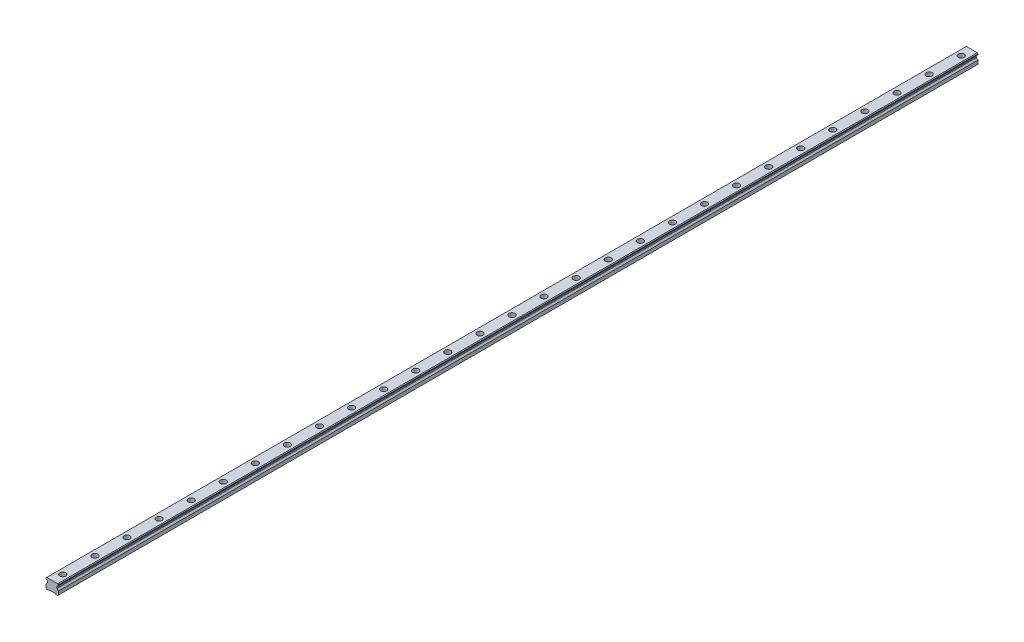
ISO-10303-21;
HEADER;
FILE_DESCRIPTION(('STEP AP214'),'2;1');
FILE_NAME('part.step','',(''),(''),'','','');
FILE_SCHEMA(('AUTOMOTIVE_DESIGN { 1 0 10303 214 1 1 1 1 }'));
ENDSEC;
DATA;
#1=APPLICATION_CONTEXT('core data for automotive mechanical design processes');
#2=APPLICATION_PROTOCOL_DEFINITION('international standard','automotive_design',2000,#1);
#3=PRODUCT_CONTEXT('',#1,'mechanical');
#4=PRODUCT('Part','Part','',(#3));
#5=PRODUCT_RELATED_PRODUCT_CATEGORY('part','',(#4));
#6=PRODUCT_DEFINITION_FORMATION('','',#4);
#7=PRODUCT_DEFINITION_CONTEXT('part definition',#1,'design');
#8=PRODUCT_DEFINITION('design','',#6,#7);
#9=PRODUCT_DEFINITION_SHAPE('','',#8);
#10=(LENGTH_UNIT() NAMED_UNIT(*) SI_UNIT(.MILLI.,.METRE.));
#11=(NAMED_UNIT(*) PLANE_ANGLE_UNIT() SI_UNIT($,.RADIAN.));
#12=(NAMED_UNIT(*) SI_UNIT($,.STERADIAN.) SOLID_ANGLE_UNIT());
#13=UNCERTAINTY_MEASURE_WITH_UNIT(LENGTH_MEASURE(1.E-05),#10,'distance_accuracy_value','');
#14=(GEOMETRIC_REPRESENTATION_CONTEXT(3) GLOBAL_UNCERTAINTY_ASSIGNED_CONTEXT((#13)) GLOBAL_UNIT_ASSIGNED_CONTEXT((#10,
#11,#12)) REPRESENTATION_CONTEXT('',''));
#15=CARTESIAN_POINT('',(0.,0.,0.));
#16=DIRECTION('',(0.,0.,1.));
#17=DIRECTION('',(1.,0.,0.));
#18=AXIS2_PLACEMENT_3D('',#15,#16,#17);
#19=CARTESIAN_POINT('',(0.,10.2,-840.));
#20=DIRECTION('',(0.,1.,0.));
#21=DIRECTION('',(0.,0.,1.));
#22=AXIS2_PLACEMENT_3D('',#19,#20,#21);
#23=PLANE('',#22);
#24=CARTESIAN_POINT('',(0.,10.2,-840.));
#25=DIRECTION('',(0.,1.,0.));
#26=DIRECTION('',(0.,0.,1.));
#27=AXIS2_PLACEMENT_3D('',#24,#25,#26);
#28=CIRCLE('',#27,3.5);
#29=CARTESIAN_POINT('',(0.,10.2,-836.5));
#30=VERTEX_POINT('',#29);
#31=EDGE_CURVE('E574',#30,#30,#28,.T.);
#32=ORIENTED_EDGE('',*,*,#31,.F.);
#33=EDGE_LOOP('',(#32));
#34=FACE_BOUND('',#33,.T.);
#35=CARTESIAN_POINT('',(0.,10.2,-840.));
#36=DIRECTION('',(0.,1.,0.));
#37=DIRECTION('',(0.,0.,1.));
#38=AXIS2_PLACEMENT_3D('',#35,#36,#37);
#39=CIRCLE('',#38,5.5);
#40=CARTESIAN_POINT('',(0.,10.2,-834.5));
#41=VERTEX_POINT('',#40);
#42=EDGE_CURVE('E11',#41,#41,#39,.T.);
#43=ORIENTED_EDGE('',*,*,#42,.T.);
#44=EDGE_LOOP('',(#43));
#45=FACE_BOUND('',#44,.T.);
#46=ADVANCED_FACE('F39',(#34,#45),#23,.T.);
#47=CARTESIAN_POINT('',(0.,10.2,-840.));
#48=DIRECTION('',(0.,1.,0.));
#49=DIRECTION('',(0.,0.,1.));
#50=AXIS2_PLACEMENT_3D('',#47,#48,#49);
#51=CYLINDRICAL_SURFACE('',#50,5.5);
#52=ORIENTED_EDGE('',*,*,#42,.F.);
#53=EDGE_LOOP('',(#52));
#54=FACE_BOUND('',#53,.T.);
#55=CARTESIAN_POINT('',(0.,19.2,-840.));
#56=DIRECTION('',(0.,1.,0.));
#57=DIRECTION('',(0.,0.,1.));
#58=AXIS2_PLACEMENT_3D('',#55,#56,#57);
#59=CIRCLE('',#58,5.5);
#60=CARTESIAN_POINT('',(0.,19.2,-834.5));
#61=VERTEX_POINT('',#60);
#62=EDGE_CURVE('E48',#61,#61,#59,.T.);
#63=ORIENTED_EDGE('',*,*,#62,.T.);
#64=EDGE_LOOP('',(#63));
#65=FACE_BOUND('',#64,.T.);
#66=ADVANCED_FACE('F995',(#54,#65),#51,.F.);
#67=CARTESIAN_POINT('',(0.,10.2,-780.));
#68=DIRECTION('',(0.,1.,0.));
#69=DIRECTION('',(0.,0.,1.));
#70=AXIS2_PLACEMENT_3D('',#67,#68,#69);
#71=PLANE('',#70);
#72=CARTESIAN_POINT('',(0.,10.2,-780.));
#73=DIRECTION('',(0.,1.,0.));
#74=DIRECTION('',(0.,0.,1.));
#75=AXIS2_PLACEMENT_3D('',#72,#73,#74);
#76=CIRCLE('',#75,3.5);
#77=CARTESIAN_POINT('',(0.,10.2,-776.5));
#78=VERTEX_POINT('',#77);
#79=EDGE_CURVE('E579',#78,#78,#76,.T.);
#80=ORIENTED_EDGE('',*,*,#79,.F.);
#81=EDGE_LOOP('',(#80));
#82=FACE_BOUND('',#81,.T.);
#83=CARTESIAN_POINT('',(0.,10.2,-780.));
#84=DIRECTION('',(0.,1.,0.));
#85=DIRECTION('',(0.,0.,1.));
#86=AXIS2_PLACEMENT_3D('',#83,#84,#85);
#87=CIRCLE('',#86,5.5);
#88=CARTESIAN_POINT('',(0.,10.2,-774.5));
#89=VERTEX_POINT('',#88);
#90=EDGE_CURVE('E558',#89,#89,#87,.T.);
#91=ORIENTED_EDGE('',*,*,#90,.T.);
#92=EDGE_LOOP('',(#91));
#93=FACE_BOUND('',#92,.T.);
#94=ADVANCED_FACE('F997',(#82,#93),#71,.T.);
#95=CARTESIAN_POINT('',(0.,10.2,-780.));
#96=DIRECTION('',(0.,1.,0.));
#97=DIRECTION('',(0.,0.,1.));
#98=AXIS2_PLACEMENT_3D('',#95,#96,#97);
#99=CYLINDRICAL_SURFACE('',#98,5.5);
#100=ORIENTED_EDGE('',*,*,#90,.F.);
#101=EDGE_LOOP('',(#100));
#102=FACE_BOUND('',#101,.T.);
#103=CARTESIAN_POINT('',(0.,19.2,-780.));
#104=DIRECTION('',(0.,1.,0.));
#105=DIRECTION('',(0.,0.,1.));
#106=AXIS2_PLACEMENT_3D('',#103,#104,#105);
#107=CIRCLE('',#106,5.5);
#108=CARTESIAN_POINT('',(0.,19.2,-774.5));
#109=VERTEX_POINT('',#108);
#110=EDGE_CURVE('E554',#109,#109,#107,.T.);
#111=ORIENTED_EDGE('',*,*,#110,.T.);
#112=EDGE_LOOP('',(#111));
#113=FACE_BOUND('',#112,.T.);
#114=ADVANCED_FACE('F1003',(#102,#113),#99,.F.);
#115=CARTESIAN_POINT('',(0.,10.2,-720.));
#116=DIRECTION('',(0.,1.,0.));
#117=DIRECTION('',(0.,0.,1.));
#118=AXIS2_PLACEMENT_3D('',#115,#116,#117);
#119=PLANE('',#118);
#120=CARTESIAN_POINT('',(0.,10.2,-720.));
#121=DIRECTION('',(0.,1.,0.));
#122=DIRECTION('',(0.,0.,1.));
#123=AXIS2_PLACEMENT_3D('',#120,#121,#122);
#124=CIRCLE('',#123,3.5);
#125=CARTESIAN_POINT('',(0.,10.2,-716.5));
#126=VERTEX_POINT('',#125);
#127=EDGE_CURVE('E584',#126,#126,#124,.T.);
#128=ORIENTED_EDGE('',*,*,#127,.F.);
#129=EDGE_LOOP('',(#128));
#130=FACE_BOUND('',#129,.T.);
#131=CARTESIAN_POINT('',(0.,10.2,-720.));
#132=DIRECTION('',(0.,1.,0.));
#133=DIRECTION('',(0.,0.,1.));
#134=AXIS2_PLACEMENT_3D('',#131,#132,#133);
#135=CIRCLE('',#134,5.5);
#136=CARTESIAN_POINT('',(0.,10.2,-714.5));
#137=VERTEX_POINT('',#136);
#138=EDGE_CURVE('E550',#137,#137,#135,.T.);
#139=ORIENTED_EDGE('',*,*,#138,.T.);
#140=EDGE_LOOP('',(#139));
#141=FACE_BOUND('',#140,.T.);
#142=ADVANCED_FACE('F1011',(#130,#141),#119,.T.);
#143=CARTESIAN_POINT('',(0.,10.2,-720.));
#144=DIRECTION('',(0.,1.,0.));
#145=DIRECTION('',(0.,0.,1.));
#146=AXIS2_PLACEMENT_3D('',#143,#144,#145);
#147=CYLINDRICAL_SURFACE('',#146,5.5);
#148=ORIENTED_EDGE('',*,*,#138,.F.);
#149=EDGE_LOOP('',(#148));
#150=FACE_BOUND('',#149,.T.);
#151=CARTESIAN_POINT('',(0.,19.2,-720.));
#152=DIRECTION('',(0.,1.,0.));
#153=DIRECTION('',(0.,0.,1.));
#154=AXIS2_PLACEMENT_3D('',#151,#152,#153);
#155=CIRCLE('',#154,5.5);
#156=CARTESIAN_POINT('',(0.,19.2,-714.5));
#157=VERTEX_POINT('',#156);
#158=EDGE_CURVE('E546',#157,#157,#155,.T.);
#159=ORIENTED_EDGE('',*,*,#158,.T.);
#160=EDGE_LOOP('',(#159));
#161=FACE_BOUND('',#160,.T.);
#162=ADVANCED_FACE('F1015',(#150,#161),#147,.F.);
#163=CARTESIAN_POINT('',(0.,10.2,-660.));
#164=DIRECTION('',(0.,1.,0.));
#165=DIRECTION('',(0.,0.,1.));
#166=AXIS2_PLACEMENT_3D('',#163,#164,#165);
#167=PLANE('',#166);
#168=CARTESIAN_POINT('',(0.,10.2,-660.));
#169=DIRECTION('',(0.,1.,0.));
#170=DIRECTION('',(0.,0.,1.));
#171=AXIS2_PLACEMENT_3D('',#168,#169,#170);
#172=CIRCLE('',#171,3.5);
#173=CARTESIAN_POINT('',(0.,10.2,-656.5));
#174=VERTEX_POINT('',#173);
#175=EDGE_CURVE('E589',#174,#174,#172,.T.);
#176=ORIENTED_EDGE('',*,*,#175,.F.);
#177=EDGE_LOOP('',(#176));
#178=FACE_BOUND('',#177,.T.);
#179=CARTESIAN_POINT('',(0.,10.2,-660.));
#180=DIRECTION('',(0.,1.,0.));
#181=DIRECTION('',(0.,0.,1.));
#182=AXIS2_PLACEMENT_3D('',#179,#180,#181);
#183=CIRCLE('',#182,5.5);
#184=CARTESIAN_POINT('',(0.,10.2,-654.5));
#185=VERTEX_POINT('',#184);
#186=EDGE_CURVE('E542',#185,#185,#183,.T.);
#187=ORIENTED_EDGE('',*,*,#186,.T.);
#188=EDGE_LOOP('',(#187));
#189=FACE_BOUND('',#188,.T.);
#190=ADVANCED_FACE('F1019',(#178,#189),#167,.T.);
#191=CARTESIAN_POINT('',(0.,10.2,-660.));
#192=DIRECTION('',(0.,1.,0.));
#193=DIRECTION('',(0.,0.,1.));
#194=AXIS2_PLACEMENT_3D('',#191,#192,#193);
#195=CYLINDRICAL_SURFACE('',#194,5.5);
#196=ORIENTED_EDGE('',*,*,#186,.F.);
#197=EDGE_LOOP('',(#196));
#198=FACE_BOUND('',#197,.T.);
#199=CARTESIAN_POINT('',(0.,19.2,-660.));
#200=DIRECTION('',(0.,1.,0.));
#201=DIRECTION('',(0.,0.,1.));
#202=AXIS2_PLACEMENT_3D('',#199,#200,#201);
#203=CIRCLE('',#202,5.5);
#204=CARTESIAN_POINT('',(0.,19.2,-654.5));
#205=VERTEX_POINT('',#204);
#206=EDGE_CURVE('E538',#205,#205,#203,.T.);
#207=ORIENTED_EDGE('',*,*,#206,.T.);
#208=EDGE_LOOP('',(#207));
#209=FACE_BOUND('',#208,.T.);
#210=ADVANCED_FACE('F1023',(#198,#209),#195,.F.);
#211=CARTESIAN_POINT('',(0.,10.2,-600.));
#212=DIRECTION('',(0.,1.,0.));
#213=DIRECTION('',(0.,0.,1.));
#214=AXIS2_PLACEMENT_3D('',#211,#212,#213);
#215=PLANE('',#214);
#216=CARTESIAN_POINT('',(0.,10.2,-600.));
#217=DIRECTION('',(0.,1.,0.));
#218=DIRECTION('',(0.,0.,1.));
#219=AXIS2_PLACEMENT_3D('',#216,#217,#218);
#220=CIRCLE('',#219,3.5);
#221=CARTESIAN_POINT('',(0.,10.2,-596.5));
#222=VERTEX_POINT('',#221);
#223=EDGE_CURVE('E594',#222,#222,#220,.T.);
#224=ORIENTED_EDGE('',*,*,#223,.F.);
#225=EDGE_LOOP('',(#224));
#226=FACE_BOUND('',#225,.T.);
#227=CARTESIAN_POINT('',(0.,10.2,-600.));
#228=DIRECTION('',(0.,1.,0.));
#229=DIRECTION('',(0.,0.,1.));
#230=AXIS2_PLACEMENT_3D('',#227,#228,#229);
#231=CIRCLE('',#230,5.5);
#232=CARTESIAN_POINT('',(0.,10.2,-594.5));
#233=VERTEX_POINT('',#232);
#234=EDGE_CURVE('E534',#233,#233,#231,.T.);
#235=ORIENTED_EDGE('',*,*,#234,.T.);
#236=EDGE_LOOP('',(#235));
#237=FACE_BOUND('',#236,.T.);
#238=ADVANCED_FACE('F1027',(#226,#237),#215,.T.);
#239=CARTESIAN_POINT('',(0.,10.2,-600.));
#240=DIRECTION('',(0.,1.,0.));
#241=DIRECTION('',(0.,0.,1.));
#242=AXIS2_PLACEMENT_3D('',#239,#240,#241);
#243=CYLINDRICAL_SURFACE('',#242,5.5);
#244=ORIENTED_EDGE('',*,*,#234,.F.);
#245=EDGE_LOOP('',(#244));
#246=FACE_BOUND('',#245,.T.);
#247=CARTESIAN_POINT('',(0.,19.2,-600.));
#248=DIRECTION('',(0.,1.,0.));
#249=DIRECTION('',(0.,0.,1.));
#250=AXIS2_PLACEMENT_3D('',#247,#248,#249);
#251=CIRCLE('',#250,5.5);
#252=CARTESIAN_POINT('',(0.,19.2,-594.5));
#253=VERTEX_POINT('',#252);
#254=EDGE_CURVE('E530',#253,#253,#251,.T.);
#255=ORIENTED_EDGE('',*,*,#254,.T.);
#256=EDGE_LOOP('',(#255));
#257=FACE_BOUND('',#256,.T.);
#258=ADVANCED_FACE('F1031',(#246,#257),#243,.F.);
#259=CARTESIAN_POINT('',(0.,10.2,-540.));
#260=DIRECTION('',(0.,1.,0.));
#261=DIRECTION('',(0.,0.,1.));
#262=AXIS2_PLACEMENT_3D('',#259,#260,#261);
#263=PLANE('',#262);
#264=CARTESIAN_POINT('',(0.,10.2,-540.));
#265=DIRECTION('',(0.,1.,0.));
#266=DIRECTION('',(0.,0.,1.));
#267=AXIS2_PLACEMENT_3D('',#264,#265,#266);
#268=CIRCLE('',#267,3.5);
#269=CARTESIAN_POINT('',(0.,10.2,-536.5));
#270=VERTEX_POINT('',#269);
#271=EDGE_CURVE('E599',#270,#270,#268,.T.);
#272=ORIENTED_EDGE('',*,*,#271,.F.);
#273=EDGE_LOOP('',(#272));
#274=FACE_BOUND('',#273,.T.);
#275=CARTESIAN_POINT('',(0.,10.2,-540.));
#276=DIRECTION('',(0.,1.,0.));
#277=DIRECTION('',(0.,0.,1.));
#278=AXIS2_PLACEMENT_3D('',#275,#276,#277);
#279=CIRCLE('',#278,5.5);
#280=CARTESIAN_POINT('',(0.,10.2,-534.5));
#281=VERTEX_POINT('',#280);
#282=EDGE_CURVE('E526',#281,#281,#279,.T.);
#283=ORIENTED_EDGE('',*,*,#282,.T.);
#284=EDGE_LOOP('',(#283));
#285=FACE_BOUND('',#284,.T.);
#286=ADVANCED_FACE('F1035',(#274,#285),#263,.T.);
#287=CARTESIAN_POINT('',(0.,10.2,-540.));
#288=DIRECTION('',(0.,1.,0.));
#289=DIRECTION('',(0.,0.,1.));
#290=AXIS2_PLACEMENT_3D('',#287,#288,#289);
#291=CYLINDRICAL_SURFACE('',#290,5.5);
#292=ORIENTED_EDGE('',*,*,#282,.F.);
#293=EDGE_LOOP('',(#292));
#294=FACE_BOUND('',#293,.T.);
#295=CARTESIAN_POINT('',(0.,19.2,-540.));
#296=DIRECTION('',(0.,1.,0.));
#297=DIRECTION('',(0.,0.,1.));
#298=AXIS2_PLACEMENT_3D('',#295,#296,#297);
#299=CIRCLE('',#298,5.5);
#300=CARTESIAN_POINT('',(0.,19.2,-534.5));
#301=VERTEX_POINT('',#300);
#302=EDGE_CURVE('E522',#301,#301,#299,.T.);
#303=ORIENTED_EDGE('',*,*,#302,.T.);
#304=EDGE_LOOP('',(#303));
#305=FACE_BOUND('',#304,.T.);
#306=ADVANCED_FACE('F1039',(#294,#305),#291,.F.);
#307=CARTESIAN_POINT('',(0.,10.2,-480.));
#308=DIRECTION('',(0.,1.,0.));
#309=DIRECTION('',(0.,0.,1.));
#310=AXIS2_PLACEMENT_3D('',#307,#308,#309);
#311=PLANE('',#310);
#312=CARTESIAN_POINT('',(0.,10.2,-480.));
#313=DIRECTION('',(0.,1.,0.));
#314=DIRECTION('',(0.,0.,1.));
#315=AXIS2_PLACEMENT_3D('',#312,#313,#314);
#316=CIRCLE('',#315,3.5);
#317=CARTESIAN_POINT('',(0.,10.2,-476.5));
#318=VERTEX_POINT('',#317);
#319=EDGE_CURVE('E604',#318,#318,#316,.T.);
#320=ORIENTED_EDGE('',*,*,#319,.F.);
#321=EDGE_LOOP('',(#320));
#322=FACE_BOUND('',#321,.T.);
#323=CARTESIAN_POINT('',(0.,10.2,-480.));
#324=DIRECTION('',(0.,1.,0.));
#325=DIRECTION('',(0.,0.,1.));
#326=AXIS2_PLACEMENT_3D('',#323,#324,#325);
#327=CIRCLE('',#326,5.5);
#328=CARTESIAN_POINT('',(0.,10.2,-474.5));
#329=VERTEX_POINT('',#328);
#330=EDGE_CURVE('E518',#329,#329,#327,.T.);
#331=ORIENTED_EDGE('',*,*,#330,.T.);
#332=EDGE_LOOP('',(#331));
#333=FACE_BOUND('',#332,.T.);
#334=ADVANCED_FACE('F1043',(#322,#333),#311,.T.);
#335=CARTESIAN_POINT('',(0.,10.2,-480.));
#336=DIRECTION('',(0.,1.,0.));
#337=DIRECTION('',(0.,0.,1.));
#338=AXIS2_PLACEMENT_3D('',#335,#336,#337);
#339=CYLINDRICAL_SURFACE('',#338,5.5);
#340=ORIENTED_EDGE('',*,*,#330,.F.);
#341=EDGE_LOOP('',(#340));
#342=FACE_BOUND('',#341,.T.);
#343=CARTESIAN_POINT('',(0.,19.2,-480.));
#344=DIRECTION('',(0.,1.,0.));
#345=DIRECTION('',(0.,0.,1.));
#346=AXIS2_PLACEMENT_3D('',#343,#344,#345);
#347=CIRCLE('',#346,5.5);
#348=CARTESIAN_POINT('',(0.,19.2,-474.5));
#349=VERTEX_POINT('',#348);
#350=EDGE_CURVE('E514',#349,#349,#347,.T.);
#351=ORIENTED_EDGE('',*,*,#350,.T.);
#352=EDGE_LOOP('',(#351));
#353=FACE_BOUND('',#352,.T.);
#354=ADVANCED_FACE('F1047',(#342,#353),#339,.F.);
#355=CARTESIAN_POINT('',(0.,10.2,-420.));
#356=DIRECTION('',(0.,1.,0.));
#357=DIRECTION('',(0.,0.,1.));
#358=AXIS2_PLACEMENT_3D('',#355,#356,#357);
#359=PLANE('',#358);
#360=CARTESIAN_POINT('',(0.,10.2,-420.));
#361=DIRECTION('',(0.,1.,0.));
#362=DIRECTION('',(0.,0.,1.));
#363=AXIS2_PLACEMENT_3D('',#360,#361,#362);
#364=CIRCLE('',#363,3.5);
#365=CARTESIAN_POINT('',(0.,10.2,-416.5));
#366=VERTEX_POINT('',#365);
#367=EDGE_CURVE('E609',#366,#366,#364,.T.);
#368=ORIENTED_EDGE('',*,*,#367,.F.);
#369=EDGE_LOOP('',(#368));
#370=FACE_BOUND('',#369,.T.);
#371=CARTESIAN_POINT('',(0.,10.2,-420.));
#372=DIRECTION('',(0.,1.,0.));
#373=DIRECTION('',(0.,0.,1.));
#374=AXIS2_PLACEMENT_3D('',#371,#372,#373);
#375=CIRCLE('',#374,5.5);
#376=CARTESIAN_POINT('',(0.,10.2,-414.5));
#377=VERTEX_POINT('',#376);
#378=EDGE_CURVE('E510',#377,#377,#375,.T.);
#379=ORIENTED_EDGE('',*,*,#378,.T.);
#380=EDGE_LOOP('',(#379));
#381=FACE_BOUND('',#380,.T.);
#382=ADVANCED_FACE('F1051',(#370,#381),#359,.T.);
#383=CARTESIAN_POINT('',(0.,10.2,-420.));
#384=DIRECTION('',(0.,1.,0.));
#385=DIRECTION('',(0.,0.,1.));
#386=AXIS2_PLACEMENT_3D('',#383,#384,#385);
#387=CYLINDRICAL_SURFACE('',#386,5.5);
#388=ORIENTED_EDGE('',*,*,#378,.F.);
#389=EDGE_LOOP('',(#388));
#390=FACE_BOUND('',#389,.T.);
#391=CARTESIAN_POINT('',(0.,19.2,-420.));
#392=DIRECTION('',(0.,1.,0.));
#393=DIRECTION('',(0.,0.,1.));
#394=AXIS2_PLACEMENT_3D('',#391,#392,#393);
#395=CIRCLE('',#394,5.5);
#396=CARTESIAN_POINT('',(0.,19.2,-414.5));
#397=VERTEX_POINT('',#396);
#398=EDGE_CURVE('E506',#397,#397,#395,.T.);
#399=ORIENTED_EDGE('',*,*,#398,.T.);
#400=EDGE_LOOP('',(#399));
#401=FACE_BOUND('',#400,.T.);
#402=ADVANCED_FACE('F1055',(#390,#401),#387,.F.);
#403=CARTESIAN_POINT('',(0.,10.2,-360.));
#404=DIRECTION('',(0.,1.,0.));
#405=DIRECTION('',(0.,0.,1.));
#406=AXIS2_PLACEMENT_3D('',#403,#404,#405);
#407=PLANE('',#406);
#408=CARTESIAN_POINT('',(0.,10.2,-360.));
#409=DIRECTION('',(0.,1.,0.));
#410=DIRECTION('',(0.,0.,1.));
#411=AXIS2_PLACEMENT_3D('',#408,#409,#410);
#412=CIRCLE('',#411,3.5);
#413=CARTESIAN_POINT('',(0.,10.2,-356.5));
#414=VERTEX_POINT('',#413);
#415=EDGE_CURVE('E614',#414,#414,#412,.T.);
#416=ORIENTED_EDGE('',*,*,#415,.F.);
#417=EDGE_LOOP('',(#416));
#418=FACE_BOUND('',#417,.T.);
#419=CARTESIAN_POINT('',(0.,10.2,-360.));
#420=DIRECTION('',(0.,1.,0.));
#421=DIRECTION('',(0.,0.,1.));
#422=AXIS2_PLACEMENT_3D('',#419,#420,#421);
#423=CIRCLE('',#422,5.5);
#424=CARTESIAN_POINT('',(0.,10.2,-354.5));
#425=VERTEX_POINT('',#424);
#426=EDGE_CURVE('E502',#425,#425,#423,.T.);
#427=ORIENTED_EDGE('',*,*,#426,.T.);
#428=EDGE_LOOP('',(#427));
#429=FACE_BOUND('',#428,.T.);
#430=ADVANCED_FACE('F1059',(#418,#429),#407,.T.);
#431=CARTESIAN_POINT('',(0.,10.2,-360.));
#432=DIRECTION('',(0.,1.,0.));
#433=DIRECTION('',(0.,0.,1.));
#434=AXIS2_PLACEMENT_3D('',#431,#432,#433);
#435=CYLINDRICAL_SURFACE('',#434,5.5);
#436=ORIENTED_EDGE('',*,*,#426,.F.);
#437=EDGE_LOOP('',(#436));
#438=FACE_BOUND('',#437,.T.);
#439=CARTESIAN_POINT('',(0.,19.2,-360.));
#440=DIRECTION('',(0.,1.,0.));
#441=DIRECTION('',(0.,0.,1.));
#442=AXIS2_PLACEMENT_3D('',#439,#440,#441);
#443=CIRCLE('',#442,5.5);
#444=CARTESIAN_POINT('',(0.,19.2,-354.5));
#445=VERTEX_POINT('',#444);
#446=EDGE_CURVE('E498',#445,#445,#443,.T.);
#447=ORIENTED_EDGE('',*,*,#446,.T.);
#448=EDGE_LOOP('',(#447));
#449=FACE_BOUND('',#448,.T.);
#450=ADVANCED_FACE('F1063',(#438,#449),#435,.F.);
#451=CARTESIAN_POINT('',(0.,10.2,-300.));
#452=DIRECTION('',(0.,1.,0.));
#453=DIRECTION('',(0.,0.,1.));
#454=AXIS2_PLACEMENT_3D('',#451,#452,#453);
#455=PLANE('',#454);
#456=CARTESIAN_POINT('',(0.,10.2,-300.));
#457=DIRECTION('',(0.,1.,0.));
#458=DIRECTION('',(0.,0.,1.));
#459=AXIS2_PLACEMENT_3D('',#456,#457,#458);
#460=CIRCLE('',#459,3.5);
#461=CARTESIAN_POINT('',(0.,10.2,-296.5));
#462=VERTEX_POINT('',#461);
#463=EDGE_CURVE('E619',#462,#462,#460,.T.);
#464=ORIENTED_EDGE('',*,*,#463,.F.);
#465=EDGE_LOOP('',(#464));
#466=FACE_BOUND('',#465,.T.);
#467=CARTESIAN_POINT('',(0.,10.2,-300.));
#468=DIRECTION('',(0.,1.,0.));
#469=DIRECTION('',(0.,0.,1.));
#470=AXIS2_PLACEMENT_3D('',#467,#468,#469);
#471=CIRCLE('',#470,5.5);
#472=CARTESIAN_POINT('',(0.,10.2,-294.5));
#473=VERTEX_POINT('',#472);
#474=EDGE_CURVE('E494',#473,#473,#471,.T.);
#475=ORIENTED_EDGE('',*,*,#474,.T.);
#476=EDGE_LOOP('',(#475));
#477=FACE_BOUND('',#476,.T.);
#478=ADVANCED_FACE('F1067',(#466,#477),#455,.T.);
#479=CARTESIAN_POINT('',(0.,10.2,-300.));
#480=DIRECTION('',(0.,1.,0.));
#481=DIRECTION('',(0.,0.,1.));
#482=AXIS2_PLACEMENT_3D('',#479,#480,#481);
#483=CYLINDRICAL_SURFACE('',#482,5.5);
#484=ORIENTED_EDGE('',*,*,#474,.F.);
#485=EDGE_LOOP('',(#484));
#486=FACE_BOUND('',#485,.T.);
#487=CARTESIAN_POINT('',(0.,19.2,-300.));
#488=DIRECTION('',(0.,1.,0.));
#489=DIRECTION('',(0.,0.,1.));
#490=AXIS2_PLACEMENT_3D('',#487,#488,#489);
#491=CIRCLE('',#490,5.5);
#492=CARTESIAN_POINT('',(0.,19.2,-294.5));
#493=VERTEX_POINT('',#492);
#494=EDGE_CURVE('E490',#493,#493,#491,.T.);
#495=ORIENTED_EDGE('',*,*,#494,.T.);
#496=EDGE_LOOP('',(#495));
#497=FACE_BOUND('',#496,.T.);
#498=ADVANCED_FACE('F1071',(#486,#497),#483,.F.);
#499=CARTESIAN_POINT('',(0.,10.2,-240.));
#500=DIRECTION('',(0.,1.,0.));
#501=DIRECTION('',(0.,0.,1.));
#502=AXIS2_PLACEMENT_3D('',#499,#500,#501);
#503=PLANE('',#502);
#504=CARTESIAN_POINT('',(0.,10.2,-240.));
#505=DIRECTION('',(0.,1.,0.));
#506=DIRECTION('',(0.,0.,1.));
#507=AXIS2_PLACEMENT_3D('',#504,#505,#506);
#508=CIRCLE('',#507,3.5);
#509=CARTESIAN_POINT('',(0.,10.2,-236.5));
#510=VERTEX_POINT('',#509);
#511=EDGE_CURVE('E624',#510,#510,#508,.T.);
#512=ORIENTED_EDGE('',*,*,#511,.F.);
#513=EDGE_LOOP('',(#512));
#514=FACE_BOUND('',#513,.T.);
#515=CARTESIAN_POINT('',(0.,10.2,-240.));
#516=DIRECTION('',(0.,1.,0.));
#517=DIRECTION('',(0.,0.,1.));
#518=AXIS2_PLACEMENT_3D('',#515,#516,#517);
#519=CIRCLE('',#518,5.5);
#520=CARTESIAN_POINT('',(0.,10.2,-234.5));
#521=VERTEX_POINT('',#520);
#522=EDGE_CURVE('E486',#521,#521,#519,.T.);
#523=ORIENTED_EDGE('',*,*,#522,.T.);
#524=EDGE_LOOP('',(#523));
#525=FACE_BOUND('',#524,.T.);
#526=ADVANCED_FACE('F1075',(#514,#525),#503,.T.);
#527=CARTESIAN_POINT('',(0.,10.2,-240.));
#528=DIRECTION('',(0.,1.,0.));
#529=DIRECTION('',(0.,0.,1.));
#530=AXIS2_PLACEMENT_3D('',#527,#528,#529);
#531=CYLINDRICAL_SURFACE('',#530,5.5);
#532=ORIENTED_EDGE('',*,*,#522,.F.);
#533=EDGE_LOOP('',(#532));
#534=FACE_BOUND('',#533,.T.);
#535=CARTESIAN_POINT('',(0.,19.2,-240.));
#536=DIRECTION('',(0.,1.,0.));
#537=DIRECTION('',(0.,0.,1.));
#538=AXIS2_PLACEMENT_3D('',#535,#536,#537);
#539=CIRCLE('',#538,5.5);
#540=CARTESIAN_POINT('',(0.,19.2,-234.5));
#541=VERTEX_POINT('',#540);
#542=EDGE_CURVE('E482',#541,#541,#539,.T.);
#543=ORIENTED_EDGE('',*,*,#542,.T.);
#544=EDGE_LOOP('',(#543));
#545=FACE_BOUND('',#544,.T.);
#546=ADVANCED_FACE('F1079',(#534,#545),#531,.F.);
#547=CARTESIAN_POINT('',(0.,10.2,-180.));
#548=DIRECTION('',(0.,1.,0.));
#549=DIRECTION('',(0.,0.,1.));
#550=AXIS2_PLACEMENT_3D('',#547,#548,#549);
#551=PLANE('',#550);
#552=CARTESIAN_POINT('',(0.,10.2,-180.));
#553=DIRECTION('',(0.,1.,0.));
#554=DIRECTION('',(0.,0.,1.));
#555=AXIS2_PLACEMENT_3D('',#552,#553,#554);
#556=CIRCLE('',#555,3.5);
#557=CARTESIAN_POINT('',(0.,10.2,-176.5));
#558=VERTEX_POINT('',#557);
#559=EDGE_CURVE('E629',#558,#558,#556,.T.);
#560=ORIENTED_EDGE('',*,*,#559,.F.);
#561=EDGE_LOOP('',(#560));
#562=FACE_BOUND('',#561,.T.);
#563=CARTESIAN_POINT('',(0.,10.2,-180.));
#564=DIRECTION('',(0.,1.,0.));
#565=DIRECTION('',(0.,0.,1.));
#566=AXIS2_PLACEMENT_3D('',#563,#564,#565);
#567=CIRCLE('',#566,5.5);
#568=CARTESIAN_POINT('',(0.,10.2,-174.5));
#569=VERTEX_POINT('',#568);
#570=EDGE_CURVE('E478',#569,#569,#567,.T.);
#571=ORIENTED_EDGE('',*,*,#570,.T.);
#572=EDGE_LOOP('',(#571));
#573=FACE_BOUND('',#572,.T.);
#574=ADVANCED_FACE('F1083',(#562,#573),#551,.T.);
#575=CARTESIAN_POINT('',(0.,10.2,-180.));
#576=DIRECTION('',(0.,1.,0.));
#577=DIRECTION('',(0.,0.,1.));
#578=AXIS2_PLACEMENT_3D('',#575,#576,#577);
#579=CYLINDRICAL_SURFACE('',#578,5.5);
#580=ORIENTED_EDGE('',*,*,#570,.F.);
#581=EDGE_LOOP('',(#580));
#582=FACE_BOUND('',#581,.T.);
#583=CARTESIAN_POINT('',(0.,19.2,-180.));
#584=DIRECTION('',(0.,1.,0.));
#585=DIRECTION('',(0.,0.,1.));
#586=AXIS2_PLACEMENT_3D('',#583,#584,#585);
#587=CIRCLE('',#586,5.5);
#588=CARTESIAN_POINT('',(0.,19.2,-174.5));
#589=VERTEX_POINT('',#588);
#590=EDGE_CURVE('E474',#589,#589,#587,.T.);
#591=ORIENTED_EDGE('',*,*,#590,.T.);
#592=EDGE_LOOP('',(#591));
#593=FACE_BOUND('',#592,.T.);
#594=ADVANCED_FACE('F1087',(#582,#593),#579,.F.);
#595=CARTESIAN_POINT('',(0.,10.2,-120.));
#596=DIRECTION('',(0.,1.,0.));
#597=DIRECTION('',(0.,0.,1.));
#598=AXIS2_PLACEMENT_3D('',#595,#596,#597);
#599=PLANE('',#598);
#600=CARTESIAN_POINT('',(0.,10.2,-120.));
#601=DIRECTION('',(0.,1.,0.));
#602=DIRECTION('',(0.,0.,1.));
#603=AXIS2_PLACEMENT_3D('',#600,#601,#602);
#604=CIRCLE('',#603,3.5);
#605=CARTESIAN_POINT('',(0.,10.2,-116.5));
#606=VERTEX_POINT('',#605);
#607=EDGE_CURVE('E634',#606,#606,#604,.T.);
#608=ORIENTED_EDGE('',*,*,#607,.F.);
#609=EDGE_LOOP('',(#608));
#610=FACE_BOUND('',#609,.T.);
#611=CARTESIAN_POINT('',(0.,10.2,-120.));
#612=DIRECTION('',(0.,1.,0.));
#613=DIRECTION('',(0.,0.,1.));
#614=AXIS2_PLACEMENT_3D('',#611,#612,#613);
#615=CIRCLE('',#614,5.5);
#616=CARTESIAN_POINT('',(0.,10.2,-114.5));
#617=VERTEX_POINT('',#616);
#618=EDGE_CURVE('E470',#617,#617,#615,.T.);
#619=ORIENTED_EDGE('',*,*,#618,.T.);
#620=EDGE_LOOP('',(#619));
#621=FACE_BOUND('',#620,.T.);
#622=ADVANCED_FACE('F1091',(#610,#621),#599,.T.);
#623=CARTESIAN_POINT('',(0.,10.2,-120.));
#624=DIRECTION('',(0.,1.,0.));
#625=DIRECTION('',(0.,0.,1.));
#626=AXIS2_PLACEMENT_3D('',#623,#624,#625);
#627=CYLINDRICAL_SURFACE('',#626,5.5);
#628=ORIENTED_EDGE('',*,*,#618,.F.);
#629=EDGE_LOOP('',(#628));
#630=FACE_BOUND('',#629,.T.);
#631=CARTESIAN_POINT('',(0.,19.2,-120.));
#632=DIRECTION('',(0.,1.,0.));
#633=DIRECTION('',(0.,0.,1.));
#634=AXIS2_PLACEMENT_3D('',#631,#632,#633);
#635=CIRCLE('',#634,5.5);
#636=CARTESIAN_POINT('',(0.,19.2,-114.5));
#637=VERTEX_POINT('',#636);
#638=EDGE_CURVE('E466',#637,#637,#635,.T.);
#639=ORIENTED_EDGE('',*,*,#638,.T.);
#640=EDGE_LOOP('',(#639));
#641=FACE_BOUND('',#640,.T.);
#642=ADVANCED_FACE('F1095',(#630,#641),#627,.F.);
#643=CARTESIAN_POINT('',(0.,10.2,-59.9999999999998));
#644=DIRECTION('',(0.,1.,0.));
#645=DIRECTION('',(0.,0.,1.));
#646=AXIS2_PLACEMENT_3D('',#643,#644,#645);
#647=PLANE('',#646);
#648=CARTESIAN_POINT('',(0.,10.2,-59.9999999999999));
#649=DIRECTION('',(0.,1.,0.));
#650=DIRECTION('',(0.,0.,1.));
#651=AXIS2_PLACEMENT_3D('',#648,#649,#650);
#652=CIRCLE('',#651,3.5);
#653=CARTESIAN_POINT('',(0.,10.2,-56.4999999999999));
#654=VERTEX_POINT('',#653);
#655=EDGE_CURVE('E639',#654,#654,#652,.T.);
#656=ORIENTED_EDGE('',*,*,#655,.F.);
#657=EDGE_LOOP('',(#656));
#658=FACE_BOUND('',#657,.T.);
#659=CARTESIAN_POINT('',(0.,10.2,-59.9999999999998));
#660=DIRECTION('',(0.,1.,0.));
#661=DIRECTION('',(0.,0.,1.));
#662=AXIS2_PLACEMENT_3D('',#659,#660,#661);
#663=CIRCLE('',#662,5.5);
#664=CARTESIAN_POINT('',(0.,10.2,-54.4999999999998));
#665=VERTEX_POINT('',#664);
#666=EDGE_CURVE('E462',#665,#665,#663,.T.);
#667=ORIENTED_EDGE('',*,*,#666,.T.);
#668=EDGE_LOOP('',(#667));
#669=FACE_BOUND('',#668,.T.);
#670=ADVANCED_FACE('F1099',(#658,#669),#647,.T.);
#671=CARTESIAN_POINT('',(0.,10.2,-59.9999999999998));
#672=DIRECTION('',(0.,1.,0.));
#673=DIRECTION('',(0.,0.,1.));
#674=AXIS2_PLACEMENT_3D('',#671,#672,#673);
#675=CYLINDRICAL_SURFACE('',#674,5.5);
#676=ORIENTED_EDGE('',*,*,#666,.F.);
#677=EDGE_LOOP('',(#676));
#678=FACE_BOUND('',#677,.T.);
#679=CARTESIAN_POINT('',(0.,19.2,-59.9999999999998));
#680=DIRECTION('',(0.,1.,0.));
#681=DIRECTION('',(0.,0.,1.));
#682=AXIS2_PLACEMENT_3D('',#679,#680,#681);
#683=CIRCLE('',#682,5.5);
#684=CARTESIAN_POINT('',(0.,19.2,-54.4999999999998));
#685=VERTEX_POINT('',#684);
#686=EDGE_CURVE('E458',#685,#685,#683,.T.);
#687=ORIENTED_EDGE('',*,*,#686,.T.);
#688=EDGE_LOOP('',(#687));
#689=FACE_BOUND('',#688,.T.);
#690=ADVANCED_FACE('F1103',(#678,#689),#675,.F.);
#691=CARTESIAN_POINT('',(0.,10.2,0.));
#692=DIRECTION('',(0.,1.,0.));
#693=DIRECTION('',(0.,0.,1.));
#694=AXIS2_PLACEMENT_3D('',#691,#692,#693);
#695=PLANE('',#694);
#696=CARTESIAN_POINT('',(0.,10.2,0.));
#697=DIRECTION('',(0.,1.,0.));
#698=DIRECTION('',(0.,0.,1.));
#699=AXIS2_PLACEMENT_3D('',#696,#697,#698);
#700=CIRCLE('',#699,3.5);
#701=CARTESIAN_POINT('',(0.,10.2,3.5));
#702=VERTEX_POINT('',#701);
#703=EDGE_CURVE('E644',#702,#702,#700,.T.);
#704=ORIENTED_EDGE('',*,*,#703,.F.);
#705=EDGE_LOOP('',(#704));
#706=FACE_BOUND('',#705,.T.);
#707=CARTESIAN_POINT('',(0.,10.2,0.));
#708=DIRECTION('',(0.,1.,0.));
#709=DIRECTION('',(0.,0.,1.));
#710=AXIS2_PLACEMENT_3D('',#707,#708,#709);
#711=CIRCLE('',#710,5.5);
#712=CARTESIAN_POINT('',(0.,10.2,5.5));
#713=VERTEX_POINT('',#712);
#714=EDGE_CURVE('E454',#713,#713,#711,.T.);
#715=ORIENTED_EDGE('',*,*,#714,.T.);
#716=EDGE_LOOP('',(#715));
#717=FACE_BOUND('',#716,.T.);
#718=ADVANCED_FACE('F1107',(#706,#717),#695,.T.);
#719=CARTESIAN_POINT('',(0.,10.2,0.));
#720=DIRECTION('',(0.,1.,0.));
#721=DIRECTION('',(0.,0.,1.));
#722=AXIS2_PLACEMENT_3D('',#719,#720,#721);
#723=CYLINDRICAL_SURFACE('',#722,5.5);
#724=ORIENTED_EDGE('',*,*,#714,.F.);
#725=EDGE_LOOP('',(#724));
#726=FACE_BOUND('',#725,.T.);
#727=CARTESIAN_POINT('',(0.,19.2,0.));
#728=DIRECTION('',(0.,1.,0.));
#729=DIRECTION('',(0.,0.,1.));
#730=AXIS2_PLACEMENT_3D('',#727,#728,#729);
#731=CIRCLE('',#730,5.5);
#732=CARTESIAN_POINT('',(0.,19.2,5.5));
#733=VERTEX_POINT('',#732);
#734=EDGE_CURVE('E450',#733,#733,#731,.T.);
#735=ORIENTED_EDGE('',*,*,#734,.T.);
#736=EDGE_LOOP('',(#735));
#737=FACE_BOUND('',#736,.T.);
#738=ADVANCED_FACE('F1111',(#726,#737),#723,.F.);
#739=CARTESIAN_POINT('',(0.,10.2,60.0000000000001));
#740=DIRECTION('',(0.,1.,0.));
#741=DIRECTION('',(0.,0.,1.));
#742=AXIS2_PLACEMENT_3D('',#739,#740,#741);
#743=PLANE('',#742);
#744=CARTESIAN_POINT('',(0.,10.2,59.9999999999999));
#745=DIRECTION('',(0.,1.,0.));
#746=DIRECTION('',(0.,0.,1.));
#747=AXIS2_PLACEMENT_3D('',#744,#745,#746);
#748=CIRCLE('',#747,3.5);
#749=CARTESIAN_POINT('',(0.,10.2,63.4999999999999));
#750=VERTEX_POINT('',#749);
#751=EDGE_CURVE('E649',#750,#750,#748,.T.);
#752=ORIENTED_EDGE('',*,*,#751,.F.);
#753=EDGE_LOOP('',(#752));
#754=FACE_BOUND('',#753,.T.);
#755=CARTESIAN_POINT('',(0.,10.2,60.0000000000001));
#756=DIRECTION('',(0.,1.,0.));
#757=DIRECTION('',(0.,0.,1.));
#758=AXIS2_PLACEMENT_3D('',#755,#756,#757);
#759=CIRCLE('',#758,5.5);
#760=CARTESIAN_POINT('',(0.,10.2,65.5000000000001));
#761=VERTEX_POINT('',#760);
#762=EDGE_CURVE('E446',#761,#761,#759,.T.);
#763=ORIENTED_EDGE('',*,*,#762,.T.);
#764=EDGE_LOOP('',(#763));
#765=FACE_BOUND('',#764,.T.);
#766=ADVANCED_FACE('F1115',(#754,#765),#743,.T.);
#767=CARTESIAN_POINT('',(0.,10.2,60.0000000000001));
#768=DIRECTION('',(0.,1.,0.));
#769=DIRECTION('',(0.,0.,1.));
#770=AXIS2_PLACEMENT_3D('',#767,#768,#769);
#771=CYLINDRICAL_SURFACE('',#770,5.5);
#772=ORIENTED_EDGE('',*,*,#762,.F.);
#773=EDGE_LOOP('',(#772));
#774=FACE_BOUND('',#773,.T.);
#775=CARTESIAN_POINT('',(0.,19.2,60.0000000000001));
#776=DIRECTION('',(0.,1.,0.));
#777=DIRECTION('',(0.,0.,1.));
#778=AXIS2_PLACEMENT_3D('',#775,#776,#777);
#779=CIRCLE('',#778,5.5);
#780=CARTESIAN_POINT('',(0.,19.2,65.5000000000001));
#781=VERTEX_POINT('',#780);
#782=EDGE_CURVE('E442',#781,#781,#779,.T.);
#783=ORIENTED_EDGE('',*,*,#782,.T.);
#784=EDGE_LOOP('',(#783));
#785=FACE_BOUND('',#784,.T.);
#786=ADVANCED_FACE('F1119',(#774,#785),#771,.F.);
#787=CARTESIAN_POINT('',(0.,10.2,120.));
#788=DIRECTION('',(0.,1.,0.));
#789=DIRECTION('',(0.,0.,1.));
#790=AXIS2_PLACEMENT_3D('',#787,#788,#789);
#791=PLANE('',#790);
#792=CARTESIAN_POINT('',(0.,10.2,120.));
#793=DIRECTION('',(0.,1.,0.));
#794=DIRECTION('',(0.,0.,1.));
#795=AXIS2_PLACEMENT_3D('',#792,#793,#794);
#796=CIRCLE('',#795,3.5);
#797=CARTESIAN_POINT('',(0.,10.2,123.5));
#798=VERTEX_POINT('',#797);
#799=EDGE_CURVE('E654',#798,#798,#796,.T.);
#800=ORIENTED_EDGE('',*,*,#799,.F.);
#801=EDGE_LOOP('',(#800));
#802=FACE_BOUND('',#801,.T.);
#803=CARTESIAN_POINT('',(0.,10.2,120.));
#804=DIRECTION('',(0.,1.,0.));
#805=DIRECTION('',(0.,0.,1.));
#806=AXIS2_PLACEMENT_3D('',#803,#804,#805);
#807=CIRCLE('',#806,5.5);
#808=CARTESIAN_POINT('',(0.,10.2,125.5));
#809=VERTEX_POINT('',#808);
#810=EDGE_CURVE('E438',#809,#809,#807,.T.);
#811=ORIENTED_EDGE('',*,*,#810,.T.);
#812=EDGE_LOOP('',(#811));
#813=FACE_BOUND('',#812,.T.);
#814=ADVANCED_FACE('F1123',(#802,#813),#791,.T.);
#815=CARTESIAN_POINT('',(0.,10.2,120.));
#816=DIRECTION('',(0.,1.,0.));
#817=DIRECTION('',(0.,0.,1.));
#818=AXIS2_PLACEMENT_3D('',#815,#816,#817);
#819=CYLINDRICAL_SURFACE('',#818,5.5);
#820=ORIENTED_EDGE('',*,*,#810,.F.);
#821=EDGE_LOOP('',(#820));
#822=FACE_BOUND('',#821,.T.);
#823=CARTESIAN_POINT('',(0.,19.2,120.));
#824=DIRECTION('',(0.,1.,0.));
#825=DIRECTION('',(0.,0.,1.));
#826=AXIS2_PLACEMENT_3D('',#823,#824,#825);
#827=CIRCLE('',#826,5.5);
#828=CARTESIAN_POINT('',(0.,19.2,125.5));
#829=VERTEX_POINT('',#828);
#830=EDGE_CURVE('E434',#829,#829,#827,.T.);
#831=ORIENTED_EDGE('',*,*,#830,.T.);
#832=EDGE_LOOP('',(#831));
#833=FACE_BOUND('',#832,.T.);
#834=ADVANCED_FACE('F1127',(#822,#833),#819,.F.);
#835=CARTESIAN_POINT('',(0.,10.2,180.));
#836=DIRECTION('',(0.,1.,0.));
#837=DIRECTION('',(0.,0.,1.));
#838=AXIS2_PLACEMENT_3D('',#835,#836,#837);
#839=PLANE('',#838);
#840=CARTESIAN_POINT('',(0.,10.2,180.));
#841=DIRECTION('',(0.,1.,0.));
#842=DIRECTION('',(0.,0.,1.));
#843=AXIS2_PLACEMENT_3D('',#840,#841,#842);
#844=CIRCLE('',#843,3.5);
#845=CARTESIAN_POINT('',(0.,10.2,183.5));
#846=VERTEX_POINT('',#845);
#847=EDGE_CURVE('E659',#846,#846,#844,.T.);
#848=ORIENTED_EDGE('',*,*,#847,.F.);
#849=EDGE_LOOP('',(#848));
#850=FACE_BOUND('',#849,.T.);
#851=CARTESIAN_POINT('',(0.,10.2,180.));
#852=DIRECTION('',(0.,1.,0.));
#853=DIRECTION('',(0.,0.,1.));
#854=AXIS2_PLACEMENT_3D('',#851,#852,#853);
#855=CIRCLE('',#854,5.5);
#856=CARTESIAN_POINT('',(0.,10.2,185.5));
#857=VERTEX_POINT('',#856);
#858=EDGE_CURVE('E430',#857,#857,#855,.T.);
#859=ORIENTED_EDGE('',*,*,#858,.T.);
#860=EDGE_LOOP('',(#859));
#861=FACE_BOUND('',#860,.T.);
#862=ADVANCED_FACE('F1131',(#850,#861),#839,.T.);
#863=CARTESIAN_POINT('',(0.,10.2,180.));
#864=DIRECTION('',(0.,1.,0.));
#865=DIRECTION('',(0.,0.,1.));
#866=AXIS2_PLACEMENT_3D('',#863,#864,#865);
#867=CYLINDRICAL_SURFACE('',#866,5.5);
#868=ORIENTED_EDGE('',*,*,#858,.F.);
#869=EDGE_LOOP('',(#868));
#870=FACE_BOUND('',#869,.T.);
#871=CARTESIAN_POINT('',(0.,19.2,180.));
#872=DIRECTION('',(0.,1.,0.));
#873=DIRECTION('',(0.,0.,1.));
#874=AXIS2_PLACEMENT_3D('',#871,#872,#873);
#875=CIRCLE('',#874,5.5);
#876=CARTESIAN_POINT('',(0.,19.2,185.5));
#877=VERTEX_POINT('',#876);
#878=EDGE_CURVE('E426',#877,#877,#875,.T.);
#879=ORIENTED_EDGE('',*,*,#878,.T.);
#880=EDGE_LOOP('',(#879));
#881=FACE_BOUND('',#880,.T.);
#882=ADVANCED_FACE('F1135',(#870,#881),#867,.F.);
#883=CARTESIAN_POINT('',(0.,10.2,240.));
#884=DIRECTION('',(0.,1.,0.));
#885=DIRECTION('',(0.,0.,1.));
#886=AXIS2_PLACEMENT_3D('',#883,#884,#885);
#887=PLANE('',#886);
#888=CARTESIAN_POINT('',(0.,10.2,240.));
#889=DIRECTION('',(0.,1.,0.));
#890=DIRECTION('',(0.,0.,1.));
#891=AXIS2_PLACEMENT_3D('',#888,#889,#890);
#892=CIRCLE('',#891,3.5);
#893=CARTESIAN_POINT('',(0.,10.2,243.5));
#894=VERTEX_POINT('',#893);
#895=EDGE_CURVE('E664',#894,#894,#892,.T.);
#896=ORIENTED_EDGE('',*,*,#895,.F.);
#897=EDGE_LOOP('',(#896));
#898=FACE_BOUND('',#897,.T.);
#899=CARTESIAN_POINT('',(0.,10.2,240.));
#900=DIRECTION('',(0.,1.,0.));
#901=DIRECTION('',(0.,0.,1.));
#902=AXIS2_PLACEMENT_3D('',#899,#900,#901);
#903=CIRCLE('',#902,5.5);
#904=CARTESIAN_POINT('',(0.,10.2,245.5));
#905=VERTEX_POINT('',#904);
#906=EDGE_CURVE('E422',#905,#905,#903,.T.);
#907=ORIENTED_EDGE('',*,*,#906,.T.);
#908=EDGE_LOOP('',(#907));
#909=FACE_BOUND('',#908,.T.);
#910=ADVANCED_FACE('F1139',(#898,#909),#887,.T.);
#911=CARTESIAN_POINT('',(0.,10.2,240.));
#912=DIRECTION('',(0.,1.,0.));
#913=DIRECTION('',(0.,0.,1.));
#914=AXIS2_PLACEMENT_3D('',#911,#912,#913);
#915=CYLINDRICAL_SURFACE('',#914,5.5);
#916=ORIENTED_EDGE('',*,*,#906,.F.);
#917=EDGE_LOOP('',(#916));
#918=FACE_BOUND('',#917,.T.);
#919=CARTESIAN_POINT('',(0.,19.2,240.));
#920=DIRECTION('',(0.,1.,0.));
#921=DIRECTION('',(0.,0.,1.));
#922=AXIS2_PLACEMENT_3D('',#919,#920,#921);
#923=CIRCLE('',#922,5.5);
#924=CARTESIAN_POINT('',(0.,19.2,245.5));
#925=VERTEX_POINT('',#924);
#926=EDGE_CURVE('E418',#925,#925,#923,.T.);
#927=ORIENTED_EDGE('',*,*,#926,.T.);
#928=EDGE_LOOP('',(#927));
#929=FACE_BOUND('',#928,.T.);
#930=ADVANCED_FACE('F1143',(#918,#929),#915,.F.);
#931=CARTESIAN_POINT('',(0.,10.2,300.));
#932=DIRECTION('',(0.,1.,0.));
#933=DIRECTION('',(0.,0.,1.));
#934=AXIS2_PLACEMENT_3D('',#931,#932,#933);
#935=PLANE('',#934);
#936=CARTESIAN_POINT('',(0.,10.2,300.));
#937=DIRECTION('',(0.,1.,0.));
#938=DIRECTION('',(0.,0.,1.));
#939=AXIS2_PLACEMENT_3D('',#936,#937,#938);
#940=CIRCLE('',#939,3.5);
#941=CARTESIAN_POINT('',(0.,10.2,303.5));
#942=VERTEX_POINT('',#941);
#943=EDGE_CURVE('E669',#942,#942,#940,.T.);
#944=ORIENTED_EDGE('',*,*,#943,.F.);
#945=EDGE_LOOP('',(#944));
#946=FACE_BOUND('',#945,.T.);
#947=CARTESIAN_POINT('',(0.,10.2,300.));
#948=DIRECTION('',(0.,1.,0.));
#949=DIRECTION('',(0.,0.,1.));
#950=AXIS2_PLACEMENT_3D('',#947,#948,#949);
#951=CIRCLE('',#950,5.5);
#952=CARTESIAN_POINT('',(0.,10.2,305.5));
#953=VERTEX_POINT('',#952);
#954=EDGE_CURVE('E414',#953,#953,#951,.T.);
#955=ORIENTED_EDGE('',*,*,#954,.T.);
#956=EDGE_LOOP('',(#955));
#957=FACE_BOUND('',#956,.T.);
#958=ADVANCED_FACE('F1147',(#946,#957),#935,.T.);
#959=CARTESIAN_POINT('',(0.,10.2,300.));
#960=DIRECTION('',(0.,1.,0.));
#961=DIRECTION('',(0.,0.,1.));
#962=AXIS2_PLACEMENT_3D('',#959,#960,#961);
#963=CYLINDRICAL_SURFACE('',#962,5.5);
#964=ORIENTED_EDGE('',*,*,#954,.F.);
#965=EDGE_LOOP('',(#964));
#966=FACE_BOUND('',#965,.T.);
#967=CARTESIAN_POINT('',(0.,19.2,300.));
#968=DIRECTION('',(0.,1.,0.));
#969=DIRECTION('',(0.,0.,1.));
#970=AXIS2_PLACEMENT_3D('',#967,#968,#969);
#971=CIRCLE('',#970,5.5);
#972=CARTESIAN_POINT('',(0.,19.2,305.5));
#973=VERTEX_POINT('',#972);
#974=EDGE_CURVE('E410',#973,#973,#971,.T.);
#975=ORIENTED_EDGE('',*,*,#974,.T.);
#976=EDGE_LOOP('',(#975));
#977=FACE_BOUND('',#976,.T.);
#978=ADVANCED_FACE('F1151',(#966,#977),#963,.F.);
#979=CARTESIAN_POINT('',(0.,10.2,360.));
#980=DIRECTION('',(0.,1.,0.));
#981=DIRECTION('',(0.,0.,1.));
#982=AXIS2_PLACEMENT_3D('',#979,#980,#981);
#983=PLANE('',#982);
#984=CARTESIAN_POINT('',(0.,10.2,360.));
#985=DIRECTION('',(0.,1.,0.));
#986=DIRECTION('',(0.,0.,1.));
#987=AXIS2_PLACEMENT_3D('',#984,#985,#986);
#988=CIRCLE('',#987,3.5);
#989=CARTESIAN_POINT('',(0.,10.2,363.5));
#990=VERTEX_POINT('',#989);
#991=EDGE_CURVE('E674',#990,#990,#988,.T.);
#992=ORIENTED_EDGE('',*,*,#991,.F.);
#993=EDGE_LOOP('',(#992));
#994=FACE_BOUND('',#993,.T.);
#995=CARTESIAN_POINT('',(0.,10.2,360.));
#996=DIRECTION('',(0.,1.,0.));
#997=DIRECTION('',(0.,0.,1.));
#998=AXIS2_PLACEMENT_3D('',#995,#996,#997);
#999=CIRCLE('',#998,5.5);
#1000=CARTESIAN_POINT('',(0.,10.2,365.5));
#1001=VERTEX_POINT('',#1000);
#1002=EDGE_CURVE('E406',#1001,#1001,#999,.T.);
#1003=ORIENTED_EDGE('',*,*,#1002,.T.);
#1004=EDGE_LOOP('',(#1003));
#1005=FACE_BOUND('',#1004,.T.);
#1006=ADVANCED_FACE('F1155',(#994,#1005),#983,.T.);
#1007=CARTESIAN_POINT('',(0.,10.2,360.));
#1008=DIRECTION('',(0.,1.,0.));
#1009=DIRECTION('',(0.,0.,1.));
#1010=AXIS2_PLACEMENT_3D('',#1007,#1008,#1009);
#1011=CYLINDRICAL_SURFACE('',#1010,5.5);
#1012=ORIENTED_EDGE('',*,*,#1002,.F.);
#1013=EDGE_LOOP('',(#1012));
#1014=FACE_BOUND('',#1013,.T.);
#1015=CARTESIAN_POINT('',(0.,19.2,360.));
#1016=DIRECTION('',(0.,1.,0.));
#1017=DIRECTION('',(0.,0.,1.));
#1018=AXIS2_PLACEMENT_3D('',#1015,#1016,#1017);
#1019=CIRCLE('',#1018,5.5);
#1020=CARTESIAN_POINT('',(0.,19.2,365.5));
#1021=VERTEX_POINT('',#1020);
#1022=EDGE_CURVE('E402',#1021,#1021,#1019,.T.);
#1023=ORIENTED_EDGE('',*,*,#1022,.T.);
#1024=EDGE_LOOP('',(#1023));
#1025=FACE_BOUND('',#1024,.T.);
#1026=ADVANCED_FACE('F1159',(#1014,#1025),#1011,.F.);
#1027=CARTESIAN_POINT('',(0.,10.2,420.));
#1028=DIRECTION('',(0.,1.,0.));
#1029=DIRECTION('',(0.,0.,1.));
#1030=AXIS2_PLACEMENT_3D('',#1027,#1028,#1029);
#1031=PLANE('',#1030);
#1032=CARTESIAN_POINT('',(0.,10.2,420.));
#1033=DIRECTION('',(0.,1.,0.));
#1034=DIRECTION('',(0.,0.,1.));
#1035=AXIS2_PLACEMENT_3D('',#1032,#1033,#1034);
#1036=CIRCLE('',#1035,3.5);
#1037=CARTESIAN_POINT('',(0.,10.2,423.5));
#1038=VERTEX_POINT('',#1037);
#1039=EDGE_CURVE('E679',#1038,#1038,#1036,.T.);
#1040=ORIENTED_EDGE('',*,*,#1039,.F.);
#1041=EDGE_LOOP('',(#1040));
#1042=FACE_BOUND('',#1041,.T.);
#1043=CARTESIAN_POINT('',(0.,10.2,420.));
#1044=DIRECTION('',(0.,1.,0.));
#1045=DIRECTION('',(0.,0.,1.));
#1046=AXIS2_PLACEMENT_3D('',#1043,#1044,#1045);
#1047=CIRCLE('',#1046,5.5);
#1048=CARTESIAN_POINT('',(0.,10.2,425.5));
#1049=VERTEX_POINT('',#1048);
#1050=EDGE_CURVE('E398',#1049,#1049,#1047,.T.);
#1051=ORIENTED_EDGE('',*,*,#1050,.T.);
#1052=EDGE_LOOP('',(#1051));
#1053=FACE_BOUND('',#1052,.T.);
#1054=ADVANCED_FACE('F1163',(#1042,#1053),#1031,.T.);
#1055=CARTESIAN_POINT('',(0.,10.2,420.));
#1056=DIRECTION('',(0.,1.,0.));
#1057=DIRECTION('',(0.,0.,1.));
#1058=AXIS2_PLACEMENT_3D('',#1055,#1056,#1057);
#1059=CYLINDRICAL_SURFACE('',#1058,5.5);
#1060=ORIENTED_EDGE('',*,*,#1050,.F.);
#1061=EDGE_LOOP('',(#1060));
#1062=FACE_BOUND('',#1061,.T.);
#1063=CARTESIAN_POINT('',(0.,19.2,420.));
#1064=DIRECTION('',(0.,1.,0.));
#1065=DIRECTION('',(0.,0.,1.));
#1066=AXIS2_PLACEMENT_3D('',#1063,#1064,#1065);
#1067=CIRCLE('',#1066,5.5);
#1068=CARTESIAN_POINT('',(0.,19.2,425.5));
#1069=VERTEX_POINT('',#1068);
#1070=EDGE_CURVE('E394',#1069,#1069,#1067,.T.);
#1071=ORIENTED_EDGE('',*,*,#1070,.T.);
#1072=EDGE_LOOP('',(#1071));
#1073=FACE_BOUND('',#1072,.T.);
#1074=ADVANCED_FACE('F935',(#1062,#1073),#1059,.F.);
#1075=CARTESIAN_POINT('',(0.,10.2,480.));
#1076=DIRECTION('',(0.,1.,0.));
#1077=DIRECTION('',(0.,0.,1.));
#1078=AXIS2_PLACEMENT_3D('',#1075,#1076,#1077);
#1079=PLANE('',#1078);
#1080=CARTESIAN_POINT('',(0.,10.2,480.));
#1081=DIRECTION('',(0.,1.,0.));
#1082=DIRECTION('',(0.,0.,1.));
#1083=AXIS2_PLACEMENT_3D('',#1080,#1081,#1082);
#1084=CIRCLE('',#1083,3.5);
#1085=CARTESIAN_POINT('',(0.,10.2,483.5));
#1086=VERTEX_POINT('',#1085);
#1087=EDGE_CURVE('E684',#1086,#1086,#1084,.T.);
#1088=ORIENTED_EDGE('',*,*,#1087,.F.);
#1089=EDGE_LOOP('',(#1088));
#1090=FACE_BOUND('',#1089,.T.);
#1091=CARTESIAN_POINT('',(0.,10.2,480.));
#1092=DIRECTION('',(0.,1.,0.));
#1093=DIRECTION('',(0.,0.,1.));
#1094=AXIS2_PLACEMENT_3D('',#1091,#1092,#1093);
#1095=CIRCLE('',#1094,5.5);
#1096=CARTESIAN_POINT('',(0.,10.2,485.5));
#1097=VERTEX_POINT('',#1096);
#1098=EDGE_CURVE('E390',#1097,#1097,#1095,.T.);
#1099=ORIENTED_EDGE('',*,*,#1098,.T.);
#1100=EDGE_LOOP('',(#1099));
#1101=FACE_BOUND('',#1100,.T.);
#1102=ADVANCED_FACE('F931',(#1090,#1101),#1079,.T.);
#1103=CARTESIAN_POINT('',(0.,10.2,480.));
#1104=DIRECTION('',(0.,1.,0.));
#1105=DIRECTION('',(0.,0.,1.));
#1106=AXIS2_PLACEMENT_3D('',#1103,#1104,#1105);
#1107=CYLINDRICAL_SURFACE('',#1106,5.5);
#1108=ORIENTED_EDGE('',*,*,#1098,.F.);
#1109=EDGE_LOOP('',(#1108));
#1110=FACE_BOUND('',#1109,.T.);
#1111=CARTESIAN_POINT('',(0.,19.2,480.));
#1112=DIRECTION('',(0.,1.,0.));
#1113=DIRECTION('',(0.,0.,1.));
#1114=AXIS2_PLACEMENT_3D('',#1111,#1112,#1113);
#1115=CIRCLE('',#1114,5.5);
#1116=CARTESIAN_POINT('',(0.,19.2,485.5));
#1117=VERTEX_POINT('',#1116);
#1118=EDGE_CURVE('E386',#1117,#1117,#1115,.T.);
#1119=ORIENTED_EDGE('',*,*,#1118,.T.);
#1120=EDGE_LOOP('',(#1119));
#1121=FACE_BOUND('',#1120,.T.);
#1122=ADVANCED_FACE('F934',(#1110,#1121),#1107,.F.);
#1123=CARTESIAN_POINT('',(0.,10.2,540.));
#1124=DIRECTION('',(0.,1.,0.));
#1125=DIRECTION('',(0.,0.,1.));
#1126=AXIS2_PLACEMENT_3D('',#1123,#1124,#1125);
#1127=PLANE('',#1126);
#1128=CARTESIAN_POINT('',(0.,10.2,540.));
#1129=DIRECTION('',(0.,1.,0.));
#1130=DIRECTION('',(0.,0.,1.));
#1131=AXIS2_PLACEMENT_3D('',#1128,#1129,#1130);
#1132=CIRCLE('',#1131,3.5);
#1133=CARTESIAN_POINT('',(0.,10.2,543.5));
#1134=VERTEX_POINT('',#1133);
#1135=EDGE_CURVE('E689',#1134,#1134,#1132,.T.);
#1136=ORIENTED_EDGE('',*,*,#1135,.F.);
#1137=EDGE_LOOP('',(#1136));
#1138=FACE_BOUND('',#1137,.T.);
#1139=CARTESIAN_POINT('',(0.,10.2,540.));
#1140=DIRECTION('',(0.,1.,0.));
#1141=DIRECTION('',(0.,0.,1.));
#1142=AXIS2_PLACEMENT_3D('',#1139,#1140,#1141);
#1143=CIRCLE('',#1142,5.5);
#1144=CARTESIAN_POINT('',(0.,10.2,545.5));
#1145=VERTEX_POINT('',#1144);
#1146=EDGE_CURVE('E382',#1145,#1145,#1143,.T.);
#1147=ORIENTED_EDGE('',*,*,#1146,.T.);
#1148=EDGE_LOOP('',(#1147));
#1149=FACE_BOUND('',#1148,.T.);
#1150=ADVANCED_FACE('F941',(#1138,#1149),#1127,.T.);
#1151=CARTESIAN_POINT('',(0.,10.2,540.));
#1152=DIRECTION('',(0.,1.,0.));
#1153=DIRECTION('',(0.,0.,1.));
#1154=AXIS2_PLACEMENT_3D('',#1151,#1152,#1153);
#1155=CYLINDRICAL_SURFACE('',#1154,5.5);
#1156=ORIENTED_EDGE('',*,*,#1146,.F.);
#1157=EDGE_LOOP('',(#1156));
#1158=FACE_BOUND('',#1157,.T.);
#1159=CARTESIAN_POINT('',(0.,19.2,540.));
#1160=DIRECTION('',(0.,1.,0.));
#1161=DIRECTION('',(0.,0.,1.));
#1162=AXIS2_PLACEMENT_3D('',#1159,#1160,#1161);
#1163=CIRCLE('',#1162,5.5);
#1164=CARTESIAN_POINT('',(0.,19.2,545.5));
#1165=VERTEX_POINT('',#1164);
#1166=EDGE_CURVE('E378',#1165,#1165,#1163,.T.);
#1167=ORIENTED_EDGE('',*,*,#1166,.T.);
#1168=EDGE_LOOP('',(#1167));
#1169=FACE_BOUND('',#1168,.T.);
#1170=ADVANCED_FACE('F1173',(#1158,#1169),#1155,.F.);
#1171=CARTESIAN_POINT('',(0.,10.2,600.));
#1172=DIRECTION('',(0.,1.,0.));
#1173=DIRECTION('',(0.,0.,1.));
#1174=AXIS2_PLACEMENT_3D('',#1171,#1172,#1173);
#1175=PLANE('',#1174);
#1176=CARTESIAN_POINT('',(0.,10.2,600.));
#1177=DIRECTION('',(0.,1.,0.));
#1178=DIRECTION('',(0.,0.,1.));
#1179=AXIS2_PLACEMENT_3D('',#1176,#1177,#1178);
#1180=CIRCLE('',#1179,3.5);
#1181=CARTESIAN_POINT('',(0.,10.2,603.5));
#1182=VERTEX_POINT('',#1181);
#1183=EDGE_CURVE('E693',#1182,#1182,#1180,.T.);
#1184=ORIENTED_EDGE('',*,*,#1183,.F.);
#1185=EDGE_LOOP('',(#1184));
#1186=FACE_BOUND('',#1185,.T.);
#1187=CARTESIAN_POINT('',(0.,10.2,600.));
#1188=DIRECTION('',(0.,1.,0.));
#1189=DIRECTION('',(0.,0.,1.));
#1190=AXIS2_PLACEMENT_3D('',#1187,#1188,#1189);
#1191=CIRCLE('',#1190,5.5);
#1192=CARTESIAN_POINT('',(0.,10.2,605.5));
#1193=VERTEX_POINT('',#1192);
#1194=EDGE_CURVE('E374',#1193,#1193,#1191,.T.);
#1195=ORIENTED_EDGE('',*,*,#1194,.T.);
#1196=EDGE_LOOP('',(#1195));
#1197=FACE_BOUND('',#1196,.T.);
#1198=ADVANCED_FACE('F1177',(#1186,#1197),#1175,.T.);
#1199=CARTESIAN_POINT('',(0.,10.2,600.));
#1200=DIRECTION('',(0.,1.,0.));
#1201=DIRECTION('',(0.,0.,1.));
#1202=AXIS2_PLACEMENT_3D('',#1199,#1200,#1201);
#1203=CYLINDRICAL_SURFACE('',#1202,5.5);
#1204=ORIENTED_EDGE('',*,*,#1194,.F.);
#1205=EDGE_LOOP('',(#1204));
#1206=FACE_BOUND('',#1205,.T.);
#1207=CARTESIAN_POINT('',(0.,19.2,600.));
#1208=DIRECTION('',(0.,1.,0.));
#1209=DIRECTION('',(0.,0.,1.));
#1210=AXIS2_PLACEMENT_3D('',#1207,#1208,#1209);
#1211=CIRCLE('',#1210,5.5);
#1212=CARTESIAN_POINT('',(0.,19.2,605.5));
#1213=VERTEX_POINT('',#1212);
#1214=EDGE_CURVE('E370',#1213,#1213,#1211,.T.);
#1215=ORIENTED_EDGE('',*,*,#1214,.T.);
#1216=EDGE_LOOP('',(#1215));
#1217=FACE_BOUND('',#1216,.T.);
#1218=ADVANCED_FACE('F1181',(#1206,#1217),#1203,.F.);
#1219=CARTESIAN_POINT('',(0.,10.2,660.));
#1220=DIRECTION('',(0.,1.,0.));
#1221=DIRECTION('',(0.,0.,1.));
#1222=AXIS2_PLACEMENT_3D('',#1219,#1220,#1221);
#1223=PLANE('',#1222);
#1224=CARTESIAN_POINT('',(0.,10.2,660.));
#1225=DIRECTION('',(0.,1.,0.));
#1226=DIRECTION('',(0.,0.,1.));
#1227=AXIS2_PLACEMENT_3D('',#1224,#1225,#1226);
#1228=CIRCLE('',#1227,3.5);
#1229=CARTESIAN_POINT('',(0.,10.2,663.5));
#1230=VERTEX_POINT('',#1229);
#1231=EDGE_CURVE('E697',#1230,#1230,#1228,.T.);
#1232=ORIENTED_EDGE('',*,*,#1231,.F.);
#1233=EDGE_LOOP('',(#1232));
#1234=FACE_BOUND('',#1233,.T.);
#1235=CARTESIAN_POINT('',(0.,10.2,660.));
#1236=DIRECTION('',(0.,1.,0.));
#1237=DIRECTION('',(0.,0.,1.));
#1238=AXIS2_PLACEMENT_3D('',#1235,#1236,#1237);
#1239=CIRCLE('',#1238,5.5);
#1240=CARTESIAN_POINT('',(0.,10.2,665.5));
#1241=VERTEX_POINT('',#1240);
#1242=EDGE_CURVE('E366',#1241,#1241,#1239,.T.);
#1243=ORIENTED_EDGE('',*,*,#1242,.T.);
#1244=EDGE_LOOP('',(#1243));
#1245=FACE_BOUND('',#1244,.T.);
#1246=ADVANCED_FACE('F1185',(#1234,#1245),#1223,.T.);
#1247=CARTESIAN_POINT('',(0.,10.2,660.));
#1248=DIRECTION('',(0.,1.,0.));
#1249=DIRECTION('',(0.,0.,1.));
#1250=AXIS2_PLACEMENT_3D('',#1247,#1248,#1249);
#1251=CYLINDRICAL_SURFACE('',#1250,5.5);
#1252=ORIENTED_EDGE('',*,*,#1242,.F.);
#1253=EDGE_LOOP('',(#1252));
#1254=FACE_BOUND('',#1253,.T.);
#1255=CARTESIAN_POINT('',(0.,19.2,660.));
#1256=DIRECTION('',(0.,1.,0.));
#1257=DIRECTION('',(0.,0.,1.));
#1258=AXIS2_PLACEMENT_3D('',#1255,#1256,#1257);
#1259=CIRCLE('',#1258,5.5);
#1260=CARTESIAN_POINT('',(0.,19.2,665.5));
#1261=VERTEX_POINT('',#1260);
#1262=EDGE_CURVE('E362',#1261,#1261,#1259,.T.);
#1263=ORIENTED_EDGE('',*,*,#1262,.T.);
#1264=EDGE_LOOP('',(#1263));
#1265=FACE_BOUND('',#1264,.T.);
#1266=ADVANCED_FACE('F1189',(#1254,#1265),#1251,.F.);
#1267=CARTESIAN_POINT('',(0.,10.2,720.));
#1268=DIRECTION('',(0.,1.,0.));
#1269=DIRECTION('',(0.,0.,1.));
#1270=AXIS2_PLACEMENT_3D('',#1267,#1268,#1269);
#1271=PLANE('',#1270);
#1272=CARTESIAN_POINT('',(0.,10.2,720.));
#1273=DIRECTION('',(0.,1.,0.));
#1274=DIRECTION('',(0.,0.,1.));
#1275=AXIS2_PLACEMENT_3D('',#1272,#1273,#1274);
#1276=CIRCLE('',#1275,3.5);
#1277=CARTESIAN_POINT('',(0.,10.2,723.5));
#1278=VERTEX_POINT('',#1277);
#1279=EDGE_CURVE('E711',#1278,#1278,#1276,.T.);
#1280=ORIENTED_EDGE('',*,*,#1279,.F.);
#1281=EDGE_LOOP('',(#1280));
#1282=FACE_BOUND('',#1281,.T.);
#1283=CARTESIAN_POINT('',(0.,10.2,720.));
#1284=DIRECTION('',(0.,1.,0.));
#1285=DIRECTION('',(0.,0.,1.));
#1286=AXIS2_PLACEMENT_3D('',#1283,#1284,#1285);
#1287=CIRCLE('',#1286,5.5);
#1288=CARTESIAN_POINT('',(0.,10.2,725.5));
#1289=VERTEX_POINT('',#1288);
#1290=EDGE_CURVE('E358',#1289,#1289,#1287,.T.);
#1291=ORIENTED_EDGE('',*,*,#1290,.T.);
#1292=EDGE_LOOP('',(#1291));
#1293=FACE_BOUND('',#1292,.T.);
#1294=ADVANCED_FACE('F1193',(#1282,#1293),#1271,.T.);
#1295=CARTESIAN_POINT('',(0.,10.2,720.));
#1296=DIRECTION('',(0.,1.,0.));
#1297=DIRECTION('',(0.,0.,1.));
#1298=AXIS2_PLACEMENT_3D('',#1295,#1296,#1297);
#1299=CYLINDRICAL_SURFACE('',#1298,5.5);
#1300=ORIENTED_EDGE('',*,*,#1290,.F.);
#1301=EDGE_LOOP('',(#1300));
#1302=FACE_BOUND('',#1301,.T.);
#1303=CARTESIAN_POINT('',(0.,19.2,720.));
#1304=DIRECTION('',(0.,1.,0.));
#1305=DIRECTION('',(0.,0.,1.));
#1306=AXIS2_PLACEMENT_3D('',#1303,#1304,#1305);
#1307=CIRCLE('',#1306,5.5);
#1308=CARTESIAN_POINT('',(0.,19.2,725.5));
#1309=VERTEX_POINT('',#1308);
#1310=EDGE_CURVE('E354',#1309,#1309,#1307,.T.);
#1311=ORIENTED_EDGE('',*,*,#1310,.T.);
#1312=EDGE_LOOP('',(#1311));
#1313=FACE_BOUND('',#1312,.T.);
#1314=ADVANCED_FACE('F1197',(#1302,#1313),#1299,.F.);
#1315=CARTESIAN_POINT('',(11.5,0.,860.));
#1316=DIRECTION('',(0.,1.,0.));
#1317=DIRECTION('',(-1.,0.,0.));
#1318=AXIS2_PLACEMENT_3D('',#1315,#1316,#1317);
#1319=PLANE('',#1318);
#1320=DIRECTION('',(1.,0.,0.));
#1321=VECTOR('',#1320,1.);
#1322=CARTESIAN_POINT('',(11.5,0.,-860.));
#1323=LINE('',#1322,#1321);
#1324=CARTESIAN_POINT('',(-10.25,0.,-860.));
#1325=VERTEX_POINT('',#1324);
#1326=CARTESIAN_POINT('',(-7.,0.,-860.));
#1327=VERTEX_POINT('',#1326);
#1328=EDGE_CURVE('E229',#1325,#1327,#1323,.T.);
#1329=ORIENTED_EDGE('',*,*,#1328,.T.);
#1330=DIRECTION('',(0.,0.,1.));
#1331=VECTOR('',#1330,1.);
#1332=CARTESIAN_POINT('',(-7.,0.,-860.));
#1333=LINE('',#1332,#1331);
#1334=CARTESIAN_POINT('',(-7.,0.,860.));
#1335=VERTEX_POINT('',#1334);
#1336=EDGE_CURVE('E752',#1327,#1335,#1333,.T.);
#1337=ORIENTED_EDGE('',*,*,#1336,.T.);
#1338=DIRECTION('',(1.,0.,0.));
#1339=VECTOR('',#1338,1.);
#1340=CARTESIAN_POINT('',(11.5,0.,860.));
#1341=LINE('',#1340,#1339);
#1342=CARTESIAN_POINT('',(-10.25,0.,860.));
#1343=VERTEX_POINT('',#1342);
#1344=EDGE_CURVE('E822',#1343,#1335,#1341,.T.);
#1345=ORIENTED_EDGE('',*,*,#1344,.F.);
#1346=DIRECTION('',(0.,0.,-1.));
#1347=VECTOR('',#1346,1.);
#1348=CARTESIAN_POINT('',(-10.25,0.,860.));
#1349=LINE('',#1348,#1347);
#1350=EDGE_CURVE('E290',#1343,#1325,#1349,.T.);
#1351=ORIENTED_EDGE('',*,*,#1350,.T.);
#1352=EDGE_LOOP('',(#1329,#1337,#1345,#1351));
#1353=FACE_BOUND('',#1352,.T.);
#1354=ADVANCED_FACE('F1201',(#1353),#1319,.F.);
#1355=CARTESIAN_POINT('',(-11.5,19.2,860.));
#1356=DIRECTION('',(1.,0.,0.));
#1357=DIRECTION('',(0.,1.,0.));
#1358=AXIS2_PLACEMENT_3D('',#1355,#1356,#1357);
#1359=PLANE('',#1358);
#1360=DIRECTION('',(0.,-1.,0.));
#1361=VECTOR('',#1360,1.);
#1362=CARTESIAN_POINT('',(-11.5,19.2,860.));
#1363=LINE('',#1362,#1361);
#1364=CARTESIAN_POINT('',(-11.5,17.9499999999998,860.));
#1365=VERTEX_POINT('',#1364);
#1366=CARTESIAN_POINT('',(-11.5,16.7,860.));
#1367=VERTEX_POINT('',#1366);
#1368=EDGE_CURVE('E818',#1365,#1367,#1363,.T.);
#1369=ORIENTED_EDGE('',*,*,#1368,.F.);
#1370=DIRECTION('',(0.,0.,-1.));
#1371=VECTOR('',#1370,1.);
#1372=CARTESIAN_POINT('',(-11.5,17.9499999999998,860.));
#1373=LINE('',#1372,#1371);
#1374=CARTESIAN_POINT('',(-11.5,17.9499999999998,-860.));
#1375=VERTEX_POINT('',#1374);
#1376=EDGE_CURVE('E252',#1365,#1375,#1373,.T.);
#1377=ORIENTED_EDGE('',*,*,#1376,.T.);
#1378=DIRECTION('',(0.,-1.,0.));
#1379=VECTOR('',#1378,1.);
#1380=CARTESIAN_POINT('',(-11.5,19.2,-860.));
#1381=LINE('',#1380,#1379);
#1382=CARTESIAN_POINT('',(-11.5,16.7,-860.));
#1383=VERTEX_POINT('',#1382);
#1384=EDGE_CURVE('E230',#1375,#1383,#1381,.T.);
#1385=ORIENTED_EDGE('',*,*,#1384,.T.);
#1386=DIRECTION('',(0.,0.,1.));
#1387=VECTOR('',#1386,1.);
#1388=CARTESIAN_POINT('',(-11.5,16.7,-860.));
#1389=LINE('',#1388,#1387);
#1390=EDGE_CURVE('E773',#1383,#1367,#1389,.T.);
#1391=ORIENTED_EDGE('',*,*,#1390,.T.);
#1392=EDGE_LOOP('',(#1369,#1377,#1385,#1391));
#1393=FACE_BOUND('',#1392,.T.);
#1394=ADVANCED_FACE('F846',(#1393),#1359,.F.);
#1395=CARTESIAN_POINT('',(11.5,19.2,860.));
#1396=DIRECTION('',(-1.,0.,0.));
#1397=DIRECTION('',(0.,0.,1.));
#1398=AXIS2_PLACEMENT_3D('',#1395,#1396,#1397);
#1399=PLANE('',#1398);
#1400=DIRECTION('',(0.,1.,0.));
#1401=VECTOR('',#1400,1.);
#1402=CARTESIAN_POINT('',(11.5,19.2,860.));
#1403=LINE('',#1402,#1401);
#1404=CARTESIAN_POINT('',(11.5,1.24999999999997,860.));
#1405=VERTEX_POINT('',#1404);
#1406=CARTESIAN_POINT('',(11.5,7.95,860.));
#1407=VERTEX_POINT('',#1406);
#1408=EDGE_CURVE('E827',#1405,#1407,#1403,.T.);
#1409=ORIENTED_EDGE('',*,*,#1408,.F.);
#1410=DIRECTION('',(0.,0.,-1.));
#1411=VECTOR('',#1410,1.);
#1412=CARTESIAN_POINT('',(11.5,1.24999999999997,860.));
#1413=LINE('',#1412,#1411);
#1414=CARTESIAN_POINT('',(11.5,1.24999999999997,-860.));
#1415=VERTEX_POINT('',#1414);
#1416=EDGE_CURVE('E297',#1405,#1415,#1413,.T.);
#1417=ORIENTED_EDGE('',*,*,#1416,.T.);
#1418=DIRECTION('',(0.,1.,0.));
#1419=VECTOR('',#1418,1.);
#1420=CARTESIAN_POINT('',(11.5,19.2,-860.));
#1421=LINE('',#1420,#1419);
#1422=CARTESIAN_POINT('',(11.5,7.95,-860.));
#1423=VERTEX_POINT('',#1422);
#1424=EDGE_CURVE('E243',#1415,#1423,#1421,.T.);
#1425=ORIENTED_EDGE('',*,*,#1424,.T.);
#1426=DIRECTION('',(0.,0.,1.));
#1427=VECTOR('',#1426,1.);
#1428=CARTESIAN_POINT('',(11.5,7.95,-860.));
#1429=LINE('',#1428,#1427);
#1430=EDGE_CURVE('E803',#1423,#1407,#1429,.T.);
#1431=ORIENTED_EDGE('',*,*,#1430,.T.);
#1432=EDGE_LOOP('',(#1409,#1417,#1425,#1431));
#1433=FACE_BOUND('',#1432,.T.);
#1434=ADVANCED_FACE('F1232',(#1433),#1399,.F.);
#1435=CARTESIAN_POINT('',(-11.5,7.95,-860.));
#1436=VERTEX_POINT('',#1435);
#1437=CARTESIAN_POINT('',(-11.5,1.24999999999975,-860.));
#1438=VERTEX_POINT('',#1437);
#1439=EDGE_CURVE('E239',#1436,#1438,#1381,.T.);
#1440=ORIENTED_EDGE('',*,*,#1439,.T.);
#1441=DIRECTION('',(0.,0.,1.));
#1442=VECTOR('',#1441,1.);
#1443=CARTESIAN_POINT('',(-11.5,1.24999999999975,860.));
#1444=LINE('',#1443,#1442);
#1445=CARTESIAN_POINT('',(-11.5,1.24999999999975,860.));
#1446=VERTEX_POINT('',#1445);
#1447=EDGE_CURVE('E294',#1438,#1446,#1444,.T.);
#1448=ORIENTED_EDGE('',*,*,#1447,.T.);
#1449=CARTESIAN_POINT('',(-11.5,7.95,860.));
#1450=VERTEX_POINT('',#1449);
#1451=EDGE_CURVE('E251',#1450,#1446,#1363,.T.);
#1452=ORIENTED_EDGE('',*,*,#1451,.F.);
#1453=DIRECTION('',(0.,0.,1.));
#1454=VECTOR('',#1453,1.);
#1455=CARTESIAN_POINT('',(-11.5,7.95,-860.));
#1456=LINE('',#1455,#1454);
#1457=EDGE_CURVE('E785',#1436,#1450,#1456,.T.);
#1458=ORIENTED_EDGE('',*,*,#1457,.F.);
#1459=EDGE_LOOP('',(#1440,#1448,#1452,#1458));
#1460=FACE_BOUND('',#1459,.T.);
#1461=ADVANCED_FACE('F874',(#1460),#1359,.F.);
#1462=CARTESIAN_POINT('',(7.,0.,860.));
#1463=VERTEX_POINT('',#1462);
#1464=CARTESIAN_POINT('',(10.25,0.,860.));
#1465=VERTEX_POINT('',#1464);
#1466=EDGE_CURVE('E219',#1463,#1465,#1341,.T.);
#1467=ORIENTED_EDGE('',*,*,#1466,.F.);
#1468=DIRECTION('',(0.,0.,1.));
#1469=VECTOR('',#1468,1.);
#1470=CARTESIAN_POINT('',(7.,0.,-860.));
#1471=LINE('',#1470,#1469);
#1472=CARTESIAN_POINT('',(7.,0.,-860.));
#1473=VERTEX_POINT('',#1472);
#1474=EDGE_CURVE('E206',#1473,#1463,#1471,.T.);
#1475=ORIENTED_EDGE('',*,*,#1474,.F.);
#1476=CARTESIAN_POINT('',(10.25,0.,-860.));
#1477=VERTEX_POINT('',#1476);
#1478=EDGE_CURVE('E217',#1473,#1477,#1323,.T.);
#1479=ORIENTED_EDGE('',*,*,#1478,.T.);
#1480=DIRECTION('',(0.,0.,1.));
#1481=VECTOR('',#1480,1.);
#1482=CARTESIAN_POINT('',(10.25,0.,860.));
#1483=LINE('',#1482,#1481);
#1484=EDGE_CURVE('E287',#1477,#1465,#1483,.T.);
#1485=ORIENTED_EDGE('',*,*,#1484,.T.);
#1486=EDGE_LOOP('',(#1467,#1475,#1479,#1485));
#1487=FACE_BOUND('',#1486,.T.);
#1488=ADVANCED_FACE('F215',(#1487),#1319,.F.);
#1489=CARTESIAN_POINT('',(11.5,16.7,-860.));
#1490=VERTEX_POINT('',#1489);
#1491=CARTESIAN_POINT('',(11.5,17.95,-860.));
#1492=VERTEX_POINT('',#1491);
#1493=EDGE_CURVE('E236',#1490,#1492,#1421,.T.);
#1494=ORIENTED_EDGE('',*,*,#1493,.T.);
#1495=DIRECTION('',(0.,0.,1.));
#1496=VECTOR('',#1495,1.);
#1497=CARTESIAN_POINT('',(11.5,17.95,860.));
#1498=LINE('',#1497,#1496);
#1499=CARTESIAN_POINT('',(11.5,17.95,860.));
#1500=VERTEX_POINT('',#1499);
#1501=EDGE_CURVE('E301',#1492,#1500,#1498,.T.);
#1502=ORIENTED_EDGE('',*,*,#1501,.T.);
#1503=CARTESIAN_POINT('',(11.5,16.7,860.));
#1504=VERTEX_POINT('',#1503);
#1505=EDGE_CURVE('E826',#1504,#1500,#1403,.T.);
#1506=ORIENTED_EDGE('',*,*,#1505,.F.);
#1507=DIRECTION('',(0.,0.,1.));
#1508=VECTOR('',#1507,1.);
#1509=CARTESIAN_POINT('',(11.5,16.7,-860.));
#1510=LINE('',#1509,#1508);
#1511=EDGE_CURVE('E778',#1490,#1504,#1510,.T.);
#1512=ORIENTED_EDGE('',*,*,#1511,.F.);
#1513=EDGE_LOOP('',(#1494,#1502,#1506,#1512));
#1514=FACE_BOUND('',#1513,.T.);
#1515=ADVANCED_FACE('F948',(#1514),#1399,.F.);
#1516=CARTESIAN_POINT('',(11.5,19.2,860.));
#1517=DIRECTION('',(0.,-1.,0.));
#1518=DIRECTION('',(0.,0.,-1.));
#1519=AXIS2_PLACEMENT_3D('',#1516,#1517,#1518);
#1520=PLANE('',#1519);
#1521=CARTESIAN_POINT('',(0.,19.2,780.));
#1522=DIRECTION('',(0.,1.,0.));
#1523=DIRECTION('',(0.,0.,1.));
#1524=AXIS2_PLACEMENT_3D('',#1521,#1522,#1523);
#1525=CIRCLE('',#1524,5.5);
#1526=CARTESIAN_POINT('',(0.,19.2,785.5));
#1527=VERTEX_POINT('',#1526);
#1528=EDGE_CURVE('E715',#1527,#1527,#1525,.T.);
#1529=ORIENTED_EDGE('',*,*,#1528,.F.);
#1530=EDGE_LOOP('',(#1529));
#1531=FACE_BOUND('',#1530,.T.);
#1532=CARTESIAN_POINT('',(0.,19.2,840.));
#1533=DIRECTION('',(0.,1.,0.));
#1534=DIRECTION('',(0.,0.,1.));
#1535=AXIS2_PLACEMENT_3D('',#1532,#1533,#1534);
#1536=CIRCLE('',#1535,5.5);
#1537=CARTESIAN_POINT('',(0.,19.2,845.5));
#1538=VERTEX_POINT('',#1537);
#1539=EDGE_CURVE('E731',#1538,#1538,#1536,.T.);
#1540=ORIENTED_EDGE('',*,*,#1539,.F.);
#1541=EDGE_LOOP('',(#1540));
#1542=FACE_BOUND('',#1541,.T.);
#1543=DIRECTION('',(-1.,0.,0.));
#1544=VECTOR('',#1543,1.);
#1545=CARTESIAN_POINT('',(11.5,19.2,-860.));
#1546=LINE('',#1545,#1544);
#1547=CARTESIAN_POINT('',(10.25,19.2,-860.));
#1548=VERTEX_POINT('',#1547);
#1549=CARTESIAN_POINT('',(-10.2499999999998,19.2,-860.));
#1550=VERTEX_POINT('',#1549);
#1551=EDGE_CURVE('E247',#1548,#1550,#1546,.T.);
#1552=ORIENTED_EDGE('',*,*,#1551,.T.);
#1553=DIRECTION('',(0.,0.,1.));
#1554=VECTOR('',#1553,1.);
#1555=CARTESIAN_POINT('',(-10.2499999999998,19.2,860.));
#1556=LINE('',#1555,#1554);
#1557=CARTESIAN_POINT('',(-10.2499999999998,19.2,860.));
#1558=VERTEX_POINT('',#1557);
#1559=EDGE_CURVE('E272',#1550,#1558,#1556,.T.);
#1560=ORIENTED_EDGE('',*,*,#1559,.T.);
#1561=DIRECTION('',(-1.,0.,0.));
#1562=VECTOR('',#1561,1.);
#1563=CARTESIAN_POINT('',(11.5,19.2,860.));
#1564=LINE('',#1563,#1562);
#1565=CARTESIAN_POINT('',(10.25,19.2,860.));
#1566=VERTEX_POINT('',#1565);
#1567=EDGE_CURVE('E257',#1566,#1558,#1564,.T.);
#1568=ORIENTED_EDGE('',*,*,#1567,.F.);
#1569=DIRECTION('',(0.,0.,-1.));
#1570=VECTOR('',#1569,1.);
#1571=CARTESIAN_POINT('',(10.25,19.2,860.));
#1572=LINE('',#1571,#1570);
#1573=EDGE_CURVE('E268',#1566,#1548,#1572,.T.);
#1574=ORIENTED_EDGE('',*,*,#1573,.T.);
#1575=EDGE_LOOP('',(#1552,#1560,#1568,#1574));
#1576=FACE_BOUND('',#1575,.T.);
#1577=ORIENTED_EDGE('',*,*,#1310,.F.);
#1578=EDGE_LOOP('',(#1577));
#1579=FACE_BOUND('',#1578,.T.);
#1580=ORIENTED_EDGE('',*,*,#1262,.F.);
#1581=EDGE_LOOP('',(#1580));
#1582=FACE_BOUND('',#1581,.T.);
#1583=ORIENTED_EDGE('',*,*,#1214,.F.);
#1584=EDGE_LOOP('',(#1583));
#1585=FACE_BOUND('',#1584,.T.);
#1586=ORIENTED_EDGE('',*,*,#1166,.F.);
#1587=EDGE_LOOP('',(#1586));
#1588=FACE_BOUND('',#1587,.T.);
#1589=ORIENTED_EDGE('',*,*,#1118,.F.);
#1590=EDGE_LOOP('',(#1589));
#1591=FACE_BOUND('',#1590,.T.);
#1592=ORIENTED_EDGE('',*,*,#1070,.F.);
#1593=EDGE_LOOP('',(#1592));
#1594=FACE_BOUND('',#1593,.T.);
#1595=ORIENTED_EDGE('',*,*,#1022,.F.);
#1596=EDGE_LOOP('',(#1595));
#1597=FACE_BOUND('',#1596,.T.);
#1598=ORIENTED_EDGE('',*,*,#974,.F.);
#1599=EDGE_LOOP('',(#1598));
#1600=FACE_BOUND('',#1599,.T.);
#1601=ORIENTED_EDGE('',*,*,#926,.F.);
#1602=EDGE_LOOP('',(#1601));
#1603=FACE_BOUND('',#1602,.T.);
#1604=ORIENTED_EDGE('',*,*,#878,.F.);
#1605=EDGE_LOOP('',(#1604));
#1606=FACE_BOUND('',#1605,.T.);
#1607=ORIENTED_EDGE('',*,*,#830,.F.);
#1608=EDGE_LOOP('',(#1607));
#1609=FACE_BOUND('',#1608,.T.);
#1610=ORIENTED_EDGE('',*,*,#782,.F.);
#1611=EDGE_LOOP('',(#1610));
#1612=FACE_BOUND('',#1611,.T.);
#1613=ORIENTED_EDGE('',*,*,#734,.F.);
#1614=EDGE_LOOP('',(#1613));
#1615=FACE_BOUND('',#1614,.T.);
#1616=ORIENTED_EDGE('',*,*,#686,.F.);
#1617=EDGE_LOOP('',(#1616));
#1618=FACE_BOUND('',#1617,.T.);
#1619=ORIENTED_EDGE('',*,*,#638,.F.);
#1620=EDGE_LOOP('',(#1619));
#1621=FACE_BOUND('',#1620,.T.);
#1622=ORIENTED_EDGE('',*,*,#590,.F.);
#1623=EDGE_LOOP('',(#1622));
#1624=FACE_BOUND('',#1623,.T.);
#1625=ORIENTED_EDGE('',*,*,#542,.F.);
#1626=EDGE_LOOP('',(#1625));
#1627=FACE_BOUND('',#1626,.T.);
#1628=ORIENTED_EDGE('',*,*,#494,.F.);
#1629=EDGE_LOOP('',(#1628));
#1630=FACE_BOUND('',#1629,.T.);
#1631=ORIENTED_EDGE('',*,*,#446,.F.);
#1632=EDGE_LOOP('',(#1631));
#1633=FACE_BOUND('',#1632,.T.);
#1634=ORIENTED_EDGE('',*,*,#398,.F.);
#1635=EDGE_LOOP('',(#1634));
#1636=FACE_BOUND('',#1635,.T.);
#1637=ORIENTED_EDGE('',*,*,#350,.F.);
#1638=EDGE_LOOP('',(#1637));
#1639=FACE_BOUND('',#1638,.T.);
#1640=ORIENTED_EDGE('',*,*,#302,.F.);
#1641=EDGE_LOOP('',(#1640));
#1642=FACE_BOUND('',#1641,.T.);
#1643=ORIENTED_EDGE('',*,*,#254,.F.);
#1644=EDGE_LOOP('',(#1643));
#1645=FACE_BOUND('',#1644,.T.);
#1646=ORIENTED_EDGE('',*,*,#206,.F.);
#1647=EDGE_LOOP('',(#1646));
#1648=FACE_BOUND('',#1647,.T.);
#1649=ORIENTED_EDGE('',*,*,#158,.F.);
#1650=EDGE_LOOP('',(#1649));
#1651=FACE_BOUND('',#1650,.T.);
#1652=ORIENTED_EDGE('',*,*,#110,.F.);
#1653=EDGE_LOOP('',(#1652));
#1654=FACE_BOUND('',#1653,.T.);
#1655=ORIENTED_EDGE('',*,*,#62,.F.);
#1656=EDGE_LOOP('',(#1655));
#1657=FACE_BOUND('',#1656,.T.);
#1658=ADVANCED_FACE('F945',(#1531,#1542,#1576,#1579,#1582,#1585,#1588,#1591,#1594,#1597,#1600,
#1603,#1606,#1609,#1612,#1615,#1618,#1621,#1624,#1627,#1630,#1633,#1636,#1639,#1642,#1645,#1648,
#1651,#1654,#1657),#1520,.F.);
#1659=CARTESIAN_POINT('',(0.,0.,860.));
#1660=DIRECTION('',(0.,0.,-1.));
#1661=DIRECTION('',(-1.,0.,0.));
#1662=AXIS2_PLACEMENT_3D('',#1659,#1660,#1661);
#1663=PLANE('',#1662);
#1664=ORIENTED_EDGE('',*,*,#1344,.T.);
#1665=DIRECTION('',(-0.707106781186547,-0.707106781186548,0.));
#1666=VECTOR('',#1665,1.);
#1667=CARTESIAN_POINT('',(-7.,0.,860.));
#1668=LINE('',#1667,#1666);
#1669=CARTESIAN_POINT('',(-5.75,1.25,860.));
#1670=VERTEX_POINT('',#1669);
#1671=EDGE_CURVE('E211',#1670,#1335,#1668,.T.);
#1672=ORIENTED_EDGE('',*,*,#1671,.F.);
#1673=DIRECTION('',(-1.,0.,0.));
#1674=VECTOR('',#1673,1.);
#1675=CARTESIAN_POINT('',(-5.75,1.25,860.));
#1676=LINE('',#1675,#1674);
#1677=CARTESIAN_POINT('',(5.75,1.25,860.));
#1678=VERTEX_POINT('',#1677);
#1679=EDGE_CURVE('E746',#1678,#1670,#1676,.T.);
#1680=ORIENTED_EDGE('',*,*,#1679,.F.);
#1681=DIRECTION('',(-0.707106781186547,0.707106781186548,0.));
#1682=VECTOR('',#1681,1.);
#1683=CARTESIAN_POINT('',(5.75,1.25,860.));
#1684=LINE('',#1683,#1682);
#1685=EDGE_CURVE('E736',#1463,#1678,#1684,.T.);
#1686=ORIENTED_EDGE('',*,*,#1685,.F.);
#1687=ORIENTED_EDGE('',*,*,#1466,.T.);
#1688=DIRECTION('',(-0.707106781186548,-0.707106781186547,0.));
#1689=VECTOR('',#1688,1.);
#1690=CARTESIAN_POINT('',(11.5,1.24999999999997,860.));
#1691=LINE('',#1690,#1689);
#1692=EDGE_CURVE('E278',#1465,#1405,#1691,.F.);
#1693=ORIENTED_EDGE('',*,*,#1692,.T.);
#1694=ORIENTED_EDGE('',*,*,#1408,.T.);
#1695=DIRECTION('',(0.707106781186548,-0.707106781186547,0.));
#1696=VECTOR('',#1695,1.);
#1697=CARTESIAN_POINT('',(11.5,7.95,860.));
#1698=LINE('',#1697,#1696);
#1699=CARTESIAN_POINT('',(8.94944985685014,10.5005501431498,860.));
#1700=VERTEX_POINT('',#1699);
#1701=EDGE_CURVE('E756',#1700,#1407,#1698,.T.);
#1702=ORIENTED_EDGE('',*,*,#1701,.F.);
#1703=CARTESIAN_POINT('',(9.83333333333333,11.384433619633,860.));
#1704=DIRECTION('',(0.,0.,-1.));
#1705=DIRECTION('',(-1.,0.,0.));
#1706=AXIS2_PLACEMENT_3D('',#1703,#1704,#1705);
#1707=CIRCLE('',#1706,1.25);
#1708=CARTESIAN_POINT('',(8.58333333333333,11.384433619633,860.));
#1709=VERTEX_POINT('',#1708);
#1710=EDGE_CURVE('E332',#1700,#1709,#1707,.T.);
#1711=ORIENTED_EDGE('',*,*,#1710,.T.);
#1712=DIRECTION('',(0.,-1.,0.));
#1713=VECTOR('',#1712,1.);
#1714=CARTESIAN_POINT('',(8.58333333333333,10.8666666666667,860.));
#1715=LINE('',#1714,#1713);
#1716=CARTESIAN_POINT('',(8.58333333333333,13.265566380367,860.));
#1717=VERTEX_POINT('',#1716);
#1718=EDGE_CURVE('E795',#1717,#1709,#1715,.T.);
#1719=ORIENTED_EDGE('',*,*,#1718,.F.);
#1720=CARTESIAN_POINT('',(9.83333333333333,13.265566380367,860.));
#1721=DIRECTION('',(0.,0.,-1.));
#1722=DIRECTION('',(-1.,0.,0.));
#1723=AXIS2_PLACEMENT_3D('',#1720,#1721,#1722);
#1724=CIRCLE('',#1723,1.25);
#1725=CARTESIAN_POINT('',(8.94944985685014,14.1494498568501,860.));
#1726=VERTEX_POINT('',#1725);
#1727=EDGE_CURVE('E337',#1717,#1726,#1724,.T.);
#1728=ORIENTED_EDGE('',*,*,#1727,.T.);
#1729=DIRECTION('',(-0.707106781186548,-0.707106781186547,0.));
#1730=VECTOR('',#1729,1.);
#1731=CARTESIAN_POINT('',(8.58333333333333,13.7833333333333,860.));
#1732=LINE('',#1731,#1730);
#1733=EDGE_CURVE('E806',#1504,#1726,#1732,.T.);
#1734=ORIENTED_EDGE('',*,*,#1733,.F.);
#1735=ORIENTED_EDGE('',*,*,#1505,.T.);
#1736=DIRECTION('',(0.707106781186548,-0.707106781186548,0.));
#1737=VECTOR('',#1736,1.);
#1738=CARTESIAN_POINT('',(10.25,19.2,860.));
#1739=LINE('',#1738,#1737);
#1740=EDGE_CURVE('E275',#1500,#1566,#1739,.F.);
#1741=ORIENTED_EDGE('',*,*,#1740,.T.);
#1742=ORIENTED_EDGE('',*,*,#1567,.T.);
#1743=DIRECTION('',(0.707106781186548,0.707106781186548,0.));
#1744=VECTOR('',#1743,1.);
#1745=CARTESIAN_POINT('',(-11.5,17.9499999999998,860.));
#1746=LINE('',#1745,#1744);
#1747=EDGE_CURVE('E284',#1558,#1365,#1746,.F.);
#1748=ORIENTED_EDGE('',*,*,#1747,.T.);
#1749=ORIENTED_EDGE('',*,*,#1368,.T.);
#1750=DIRECTION('',(-0.707106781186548,0.707106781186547,0.));
#1751=VECTOR('',#1750,1.);
#1752=CARTESIAN_POINT('',(-8.58333333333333,13.7833333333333,860.));
#1753=LINE('',#1752,#1751);
#1754=CARTESIAN_POINT('',(-8.94944985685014,14.1494498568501,860.));
#1755=VERTEX_POINT('',#1754);
#1756=EDGE_CURVE('E774',#1755,#1367,#1753,.T.);
#1757=ORIENTED_EDGE('',*,*,#1756,.F.);
#1758=CARTESIAN_POINT('',(-9.83333333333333,13.265566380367,860.));
#1759=DIRECTION('',(0.,0.,-1.));
#1760=DIRECTION('',(-1.,0.,0.));
#1761=AXIS2_PLACEMENT_3D('',#1758,#1759,#1760);
#1762=CIRCLE('',#1761,1.25);
#1763=CARTESIAN_POINT('',(-8.58333333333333,13.265566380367,860.));
#1764=VERTEX_POINT('',#1763);
#1765=EDGE_CURVE('E349',#1755,#1764,#1762,.T.);
#1766=ORIENTED_EDGE('',*,*,#1765,.T.);
#1767=DIRECTION('',(0.,1.,0.));
#1768=VECTOR('',#1767,1.);
#1769=CARTESIAN_POINT('',(-8.58333333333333,10.8666666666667,860.));
#1770=LINE('',#1769,#1768);
#1771=CARTESIAN_POINT('',(-8.58333333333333,11.384433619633,860.));
#1772=VERTEX_POINT('',#1771);
#1773=EDGE_CURVE('E766',#1772,#1764,#1770,.T.);
#1774=ORIENTED_EDGE('',*,*,#1773,.F.);
#1775=CARTESIAN_POINT('',(-9.83333333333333,11.384433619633,860.));
#1776=DIRECTION('',(0.,0.,-1.));
#1777=DIRECTION('',(-1.,0.,0.));
#1778=AXIS2_PLACEMENT_3D('',#1775,#1776,#1777);
#1779=CIRCLE('',#1778,1.25);
#1780=CARTESIAN_POINT('',(-8.94944985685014,10.5005501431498,860.));
#1781=VERTEX_POINT('',#1780);
#1782=EDGE_CURVE('E343',#1772,#1781,#1779,.T.);
#1783=ORIENTED_EDGE('',*,*,#1782,.T.);
#1784=DIRECTION('',(0.707106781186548,0.707106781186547,0.));
#1785=VECTOR('',#1784,1.);
#1786=CARTESIAN_POINT('',(-11.5,7.95,860.));
#1787=LINE('',#1786,#1785);
#1788=EDGE_CURVE('E777',#1450,#1781,#1787,.T.);
#1789=ORIENTED_EDGE('',*,*,#1788,.F.);
#1790=ORIENTED_EDGE('',*,*,#1451,.T.);
#1791=DIRECTION('',(-0.70710678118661,0.707106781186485,0.));
#1792=VECTOR('',#1791,1.);
#1793=CARTESIAN_POINT('',(-10.25,0.,860.));
#1794=LINE('',#1793,#1792);
#1795=EDGE_CURVE('E281',#1446,#1343,#1794,.F.);
#1796=ORIENTED_EDGE('',*,*,#1795,.T.);
#1797=EDGE_LOOP('',(#1664,#1672,#1680,#1686,#1687,#1693,#1694,#1702,#1711,#1719,#1728,#1734,
#1735,#1741,#1742,#1748,#1749,#1757,#1766,#1774,#1783,#1789,#1790,#1796));
#1798=FACE_BOUND('',#1797,.T.);
#1799=ADVANCED_FACE('F834',(#1798),#1663,.F.);
#1800=CARTESIAN_POINT('',(0.,0.,-860.));
#1801=DIRECTION('',(0.,0.,-1.));
#1802=DIRECTION('',(-1.,0.,0.));
#1803=AXIS2_PLACEMENT_3D('',#1800,#1801,#1802);
#1804=PLANE('',#1803);
#1805=DIRECTION('',(-0.707106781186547,-0.707106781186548,0.));
#1806=VECTOR('',#1805,1.);
#1807=CARTESIAN_POINT('',(-7.,0.,-860.));
#1808=LINE('',#1807,#1806);
#1809=CARTESIAN_POINT('',(-5.75,1.25,-860.));
#1810=VERTEX_POINT('',#1809);
#1811=EDGE_CURVE('E221',#1810,#1327,#1808,.T.);
#1812=ORIENTED_EDGE('',*,*,#1811,.T.);
#1813=ORIENTED_EDGE('',*,*,#1328,.F.);
#1814=DIRECTION('',(0.70710678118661,-0.707106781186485,0.));
#1815=VECTOR('',#1814,1.);
#1816=CARTESIAN_POINT('',(-5.12499999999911,-5.12500000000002,-860.));
#1817=LINE('',#1816,#1815);
#1818=EDGE_CURVE('E262',#1325,#1438,#1817,.F.);
#1819=ORIENTED_EDGE('',*,*,#1818,.T.);
#1820=ORIENTED_EDGE('',*,*,#1439,.F.);
#1821=DIRECTION('',(0.707106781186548,0.707106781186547,0.));
#1822=VECTOR('',#1821,1.);
#1823=CARTESIAN_POINT('',(-11.5,7.95,-860.));
#1824=LINE('',#1823,#1822);
#1825=CARTESIAN_POINT('',(-8.94944985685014,10.5005501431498,-860.));
#1826=VERTEX_POINT('',#1825);
#1827=EDGE_CURVE('E765',#1436,#1826,#1824,.T.);
#1828=ORIENTED_EDGE('',*,*,#1827,.T.);
#1829=CARTESIAN_POINT('',(-9.83333333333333,11.384433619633,-860.));
#1830=DIRECTION('',(0.,0.,-1.));
#1831=DIRECTION('',(-1.,0.,0.));
#1832=AXIS2_PLACEMENT_3D('',#1829,#1830,#1831);
#1833=CIRCLE('',#1832,1.25);
#1834=CARTESIAN_POINT('',(-8.58333333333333,11.384433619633,-860.));
#1835=VERTEX_POINT('',#1834);
#1836=EDGE_CURVE('E346',#1826,#1835,#1833,.F.);
#1837=ORIENTED_EDGE('',*,*,#1836,.T.);
#1838=DIRECTION('',(0.,1.,0.));
#1839=VECTOR('',#1838,1.);
#1840=CARTESIAN_POINT('',(-8.58333333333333,10.8666666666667,-860.));
#1841=LINE('',#1840,#1839);
#1842=CARTESIAN_POINT('',(-8.58333333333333,13.265566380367,-860.));
#1843=VERTEX_POINT('',#1842);
#1844=EDGE_CURVE('E770',#1835,#1843,#1841,.T.);
#1845=ORIENTED_EDGE('',*,*,#1844,.T.);
#1846=CARTESIAN_POINT('',(-9.83333333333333,13.265566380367,-860.));
#1847=DIRECTION('',(0.,0.,-1.));
#1848=DIRECTION('',(-1.,0.,0.));
#1849=AXIS2_PLACEMENT_3D('',#1846,#1847,#1848);
#1850=CIRCLE('',#1849,1.25);
#1851=CARTESIAN_POINT('',(-8.94944985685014,14.1494498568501,-860.));
#1852=VERTEX_POINT('',#1851);
#1853=EDGE_CURVE('E64',#1843,#1852,#1850,.F.);
#1854=ORIENTED_EDGE('',*,*,#1853,.T.);
#1855=DIRECTION('',(-0.707106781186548,0.707106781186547,0.));
#1856=VECTOR('',#1855,1.);
#1857=CARTESIAN_POINT('',(-8.58333333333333,13.7833333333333,-860.));
#1858=LINE('',#1857,#1856);
#1859=EDGE_CURVE('E762',#1852,#1383,#1858,.T.);
#1860=ORIENTED_EDGE('',*,*,#1859,.T.);
#1861=ORIENTED_EDGE('',*,*,#1384,.F.);
#1862=DIRECTION('',(-0.707106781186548,-0.707106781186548,0.));
#1863=VECTOR('',#1862,1.);
#1864=CARTESIAN_POINT('',(-14.7249999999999,14.7249999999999,-860.));
#1865=LINE('',#1864,#1863);
#1866=EDGE_CURVE('E265',#1375,#1550,#1865,.F.);
#1867=ORIENTED_EDGE('',*,*,#1866,.T.);
#1868=ORIENTED_EDGE('',*,*,#1551,.F.);
#1869=DIRECTION('',(-0.707106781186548,0.707106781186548,0.));
#1870=VECTOR('',#1869,1.);
#1871=CARTESIAN_POINT('',(14.725,14.725,-860.));
#1872=LINE('',#1871,#1870);
#1873=EDGE_CURVE('E256',#1548,#1492,#1872,.F.);
#1874=ORIENTED_EDGE('',*,*,#1873,.T.);
#1875=ORIENTED_EDGE('',*,*,#1493,.F.);
#1876=DIRECTION('',(-0.707106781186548,-0.707106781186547,0.));
#1877=VECTOR('',#1876,1.);
#1878=CARTESIAN_POINT('',(8.58333333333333,13.7833333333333,-860.));
#1879=LINE('',#1878,#1877);
#1880=CARTESIAN_POINT('',(8.94944985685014,14.1494498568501,-860.));
#1881=VERTEX_POINT('',#1880);
#1882=EDGE_CURVE('E794',#1490,#1881,#1879,.T.);
#1883=ORIENTED_EDGE('',*,*,#1882,.T.);
#1884=CARTESIAN_POINT('',(9.83333333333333,13.265566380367,-860.));
#1885=DIRECTION('',(0.,0.,-1.));
#1886=DIRECTION('',(-1.,0.,0.));
#1887=AXIS2_PLACEMENT_3D('',#1884,#1885,#1886);
#1888=CIRCLE('',#1887,1.25);
#1889=CARTESIAN_POINT('',(8.58333333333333,13.265566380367,-860.));
#1890=VERTEX_POINT('',#1889);
#1891=EDGE_CURVE('E340',#1881,#1890,#1888,.F.);
#1892=ORIENTED_EDGE('',*,*,#1891,.T.);
#1893=DIRECTION('',(0.,-1.,0.));
#1894=VECTOR('',#1893,1.);
#1895=CARTESIAN_POINT('',(8.58333333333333,10.8666666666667,-860.));
#1896=LINE('',#1895,#1894);
#1897=CARTESIAN_POINT('',(8.58333333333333,11.384433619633,-860.));
#1898=VERTEX_POINT('',#1897);
#1899=EDGE_CURVE('E799',#1890,#1898,#1896,.T.);
#1900=ORIENTED_EDGE('',*,*,#1899,.T.);
#1901=CARTESIAN_POINT('',(9.83333333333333,11.384433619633,-860.));
#1902=DIRECTION('',(0.,0.,-1.));
#1903=DIRECTION('',(-1.,0.,0.));
#1904=AXIS2_PLACEMENT_3D('',#1901,#1902,#1903);
#1905=CIRCLE('',#1904,1.25);
#1906=CARTESIAN_POINT('',(8.94944985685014,10.5005501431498,-860.));
#1907=VERTEX_POINT('',#1906);
#1908=EDGE_CURVE('E334',#1898,#1907,#1905,.F.);
#1909=ORIENTED_EDGE('',*,*,#1908,.T.);
#1910=DIRECTION('',(0.707106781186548,-0.707106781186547,0.));
#1911=VECTOR('',#1910,1.);
#1912=CARTESIAN_POINT('',(11.5,7.95,-860.));
#1913=LINE('',#1912,#1911);
#1914=EDGE_CURVE('E791',#1907,#1423,#1913,.T.);
#1915=ORIENTED_EDGE('',*,*,#1914,.T.);
#1916=ORIENTED_EDGE('',*,*,#1424,.F.);
#1917=DIRECTION('',(0.707106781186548,0.707106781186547,0.));
#1918=VECTOR('',#1917,1.);
#1919=CARTESIAN_POINT('',(5.125,-5.12500000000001,-860.));
#1920=LINE('',#1919,#1918);
#1921=EDGE_CURVE('E226',#1415,#1477,#1920,.F.);
#1922=ORIENTED_EDGE('',*,*,#1921,.T.);
#1923=ORIENTED_EDGE('',*,*,#1478,.F.);
#1924=DIRECTION('',(-0.707106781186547,0.707106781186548,0.));
#1925=VECTOR('',#1924,1.);
#1926=CARTESIAN_POINT('',(5.75,1.25,-860.));
#1927=LINE('',#1926,#1925);
#1928=CARTESIAN_POINT('',(5.75,1.25,-860.));
#1929=VERTEX_POINT('',#1928);
#1930=EDGE_CURVE('E202',#1473,#1929,#1927,.T.);
#1931=ORIENTED_EDGE('',*,*,#1930,.T.);
#1932=DIRECTION('',(-1.,0.,0.));
#1933=VECTOR('',#1932,1.);
#1934=CARTESIAN_POINT('',(-5.75,1.25,-860.));
#1935=LINE('',#1934,#1933);
#1936=EDGE_CURVE('E56',#1929,#1810,#1935,.T.);
#1937=ORIENTED_EDGE('',*,*,#1936,.T.);
#1938=EDGE_LOOP('',(#1812,#1813,#1819,#1820,#1828,#1837,#1845,#1854,#1860,#1861,#1867,#1868,
#1874,#1875,#1883,#1892,#1900,#1909,#1915,#1916,#1922,#1923,#1931,#1937));
#1939=FACE_BOUND('',#1938,.T.);
#1940=ADVANCED_FACE('F224',(#1939),#1804,.T.);
#1941=CARTESIAN_POINT('',(11.5,7.95,-860.));
#1942=DIRECTION('',(-0.707106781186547,-0.707106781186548,0.));
#1943=DIRECTION('',(0.707106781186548,-0.707106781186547,0.));
#1944=AXIS2_PLACEMENT_3D('',#1941,#1942,#1943);
#1945=PLANE('',#1944);
#1946=ORIENTED_EDGE('',*,*,#1914,.F.);
#1947=DIRECTION('',(0.,0.,1.));
#1948=VECTOR('',#1947,1.);
#1949=CARTESIAN_POINT('',(8.94944985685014,10.5005501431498,860.));
#1950=LINE('',#1949,#1948);
#1951=EDGE_CURVE('E304',#1907,#1700,#1950,.T.);
#1952=ORIENTED_EDGE('',*,*,#1951,.T.);
#1953=ORIENTED_EDGE('',*,*,#1701,.T.);
#1954=ORIENTED_EDGE('',*,*,#1430,.F.);
#1955=EDGE_LOOP('',(#1946,#1952,#1953,#1954));
#1956=FACE_BOUND('',#1955,.T.);
#1957=ADVANCED_FACE('F1240',(#1956),#1945,.F.);
#1958=CARTESIAN_POINT('',(8.58333333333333,10.8666666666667,-860.));
#1959=DIRECTION('',(-1.,0.,0.));
#1960=DIRECTION('',(0.,0.,1.));
#1961=AXIS2_PLACEMENT_3D('',#1958,#1959,#1960);
#1962=PLANE('',#1961);
#1963=ORIENTED_EDGE('',*,*,#1718,.T.);
#1964=DIRECTION('',(0.,0.,1.));
#1965=VECTOR('',#1964,1.);
#1966=CARTESIAN_POINT('',(8.58333333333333,11.384433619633,-860.));
#1967=LINE('',#1966,#1965);
#1968=EDGE_CURVE('E312',#1709,#1898,#1967,.F.);
#1969=ORIENTED_EDGE('',*,*,#1968,.T.);
#1970=ORIENTED_EDGE('',*,*,#1899,.F.);
#1971=DIRECTION('',(0.,0.,1.));
#1972=VECTOR('',#1971,1.);
#1973=CARTESIAN_POINT('',(8.58333333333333,13.265566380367,860.));
#1974=LINE('',#1973,#1972);
#1975=EDGE_CURVE('E308',#1890,#1717,#1974,.T.);
#1976=ORIENTED_EDGE('',*,*,#1975,.T.);
#1977=EDGE_LOOP('',(#1963,#1969,#1970,#1976));
#1978=FACE_BOUND('',#1977,.T.);
#1979=ADVANCED_FACE('F1245',(#1978),#1962,.F.);
#1980=CARTESIAN_POINT('',(8.58333333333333,13.7833333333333,-860.));
#1981=DIRECTION('',(-0.707106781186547,0.707106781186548,0.));
#1982=DIRECTION('',(-0.707106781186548,-0.707106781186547,0.));
#1983=AXIS2_PLACEMENT_3D('',#1980,#1981,#1982);
#1984=PLANE('',#1983);
#1985=ORIENTED_EDGE('',*,*,#1733,.T.);
#1986=DIRECTION('',(0.,0.,1.));
#1987=VECTOR('',#1986,1.);
#1988=CARTESIAN_POINT('',(8.94944985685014,14.1494498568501,-860.));
#1989=LINE('',#1988,#1987);
#1990=EDGE_CURVE('E315',#1726,#1881,#1989,.F.);
#1991=ORIENTED_EDGE('',*,*,#1990,.T.);
#1992=ORIENTED_EDGE('',*,*,#1882,.F.);
#1993=ORIENTED_EDGE('',*,*,#1511,.T.);
#1994=EDGE_LOOP('',(#1985,#1991,#1992,#1993));
#1995=FACE_BOUND('',#1994,.T.);
#1996=ADVANCED_FACE('F1247',(#1995),#1984,.F.);
#1997=CARTESIAN_POINT('',(-8.58333333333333,13.7833333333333,-860.));
#1998=DIRECTION('',(0.707106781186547,0.707106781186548,0.));
#1999=DIRECTION('',(-0.707106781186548,0.707106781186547,0.));
#2000=AXIS2_PLACEMENT_3D('',#1997,#1998,#1999);
#2001=PLANE('',#2000);
#2002=ORIENTED_EDGE('',*,*,#1859,.F.);
#2003=DIRECTION('',(0.,0.,1.));
#2004=VECTOR('',#2003,1.);
#2005=CARTESIAN_POINT('',(-8.94944985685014,14.1494498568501,860.));
#2006=LINE('',#2005,#2004);
#2007=EDGE_CURVE('E328',#1852,#1755,#2006,.T.);
#2008=ORIENTED_EDGE('',*,*,#2007,.T.);
#2009=ORIENTED_EDGE('',*,*,#1756,.T.);
#2010=ORIENTED_EDGE('',*,*,#1390,.F.);
#2011=EDGE_LOOP('',(#2002,#2008,#2009,#2010));
#2012=FACE_BOUND('',#2011,.T.);
#2013=ADVANCED_FACE('F851',(#2012),#2001,.F.);
#2014=CARTESIAN_POINT('',(-8.58333333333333,10.8666666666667,-860.));
#2015=DIRECTION('',(1.,0.,0.));
#2016=DIRECTION('',(0.,0.,-1.));
#2017=AXIS2_PLACEMENT_3D('',#2014,#2015,#2016);
#2018=PLANE('',#2017);
#2019=ORIENTED_EDGE('',*,*,#1844,.F.);
#2020=DIRECTION('',(0.,0.,1.));
#2021=VECTOR('',#2020,1.);
#2022=CARTESIAN_POINT('',(-8.58333333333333,11.384433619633,860.));
#2023=LINE('',#2022,#2021);
#2024=EDGE_CURVE('E321',#1835,#1772,#2023,.T.);
#2025=ORIENTED_EDGE('',*,*,#2024,.T.);
#2026=ORIENTED_EDGE('',*,*,#1773,.T.);
#2027=DIRECTION('',(0.,0.,1.));
#2028=VECTOR('',#2027,1.);
#2029=CARTESIAN_POINT('',(-8.58333333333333,13.265566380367,-860.));
#2030=LINE('',#2029,#2028);
#2031=EDGE_CURVE('E318',#1764,#1843,#2030,.F.);
#2032=ORIENTED_EDGE('',*,*,#2031,.T.);
#2033=EDGE_LOOP('',(#2019,#2025,#2026,#2032));
#2034=FACE_BOUND('',#2033,.T.);
#2035=ADVANCED_FACE('F859',(#2034),#2018,.F.);
#2036=CARTESIAN_POINT('',(-11.5,7.95,-860.));
#2037=DIRECTION('',(0.707106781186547,-0.707106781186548,0.));
#2038=DIRECTION('',(0.707106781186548,0.707106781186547,0.));
#2039=AXIS2_PLACEMENT_3D('',#2036,#2037,#2038);
#2040=PLANE('',#2039);
#2041=ORIENTED_EDGE('',*,*,#1788,.T.);
#2042=DIRECTION('',(0.,0.,1.));
#2043=VECTOR('',#2042,1.);
#2044=CARTESIAN_POINT('',(-8.94944985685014,10.5005501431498,-860.));
#2045=LINE('',#2044,#2043);
#2046=EDGE_CURVE('E325',#1781,#1826,#2045,.F.);
#2047=ORIENTED_EDGE('',*,*,#2046,.T.);
#2048=ORIENTED_EDGE('',*,*,#1827,.F.);
#2049=ORIENTED_EDGE('',*,*,#1457,.T.);
#2050=EDGE_LOOP('',(#2041,#2047,#2048,#2049));
#2051=FACE_BOUND('',#2050,.T.);
#2052=ADVANCED_FACE('F869',(#2051),#2040,.F.);
#2053=CARTESIAN_POINT('',(-11.5,17.9499999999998,860.));
#2054=DIRECTION('',(0.707106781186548,-0.707106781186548,0.));
#2055=DIRECTION('',(0.,0.,-1.));
#2056=AXIS2_PLACEMENT_3D('',#2053,#2054,#2055);
#2057=PLANE('',#2056);
#2058=ORIENTED_EDGE('',*,*,#1747,.F.);
#2059=ORIENTED_EDGE('',*,*,#1559,.F.);
#2060=ORIENTED_EDGE('',*,*,#1866,.F.);
#2061=ORIENTED_EDGE('',*,*,#1376,.F.);
#2062=EDGE_LOOP('',(#2058,#2059,#2060,#2061));
#2063=FACE_BOUND('',#2062,.T.);
#2064=ADVANCED_FACE('F843',(#2063),#2057,.F.);
#2065=CARTESIAN_POINT('',(-10.25,0.,860.));
#2066=DIRECTION('',(0.707106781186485,0.70710678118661,0.));
#2067=DIRECTION('',(0.,0.,-1.));
#2068=AXIS2_PLACEMENT_3D('',#2065,#2066,#2067);
#2069=PLANE('',#2068);
#2070=ORIENTED_EDGE('',*,*,#1795,.F.);
#2071=ORIENTED_EDGE('',*,*,#1447,.F.);
#2072=ORIENTED_EDGE('',*,*,#1818,.F.);
#2073=ORIENTED_EDGE('',*,*,#1350,.F.);
#2074=EDGE_LOOP('',(#2070,#2071,#2072,#2073));
#2075=FACE_BOUND('',#2074,.T.);
#2076=ADVANCED_FACE('F1223',(#2075),#2069,.F.);
#2077=CARTESIAN_POINT('',(11.5,1.24999999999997,860.));
#2078=DIRECTION('',(-0.707106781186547,0.707106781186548,0.));
#2079=DIRECTION('',(0.,0.,-1.));
#2080=AXIS2_PLACEMENT_3D('',#2077,#2078,#2079);
#2081=PLANE('',#2080);
#2082=ORIENTED_EDGE('',*,*,#1692,.F.);
#2083=ORIENTED_EDGE('',*,*,#1484,.F.);
#2084=ORIENTED_EDGE('',*,*,#1921,.F.);
#2085=ORIENTED_EDGE('',*,*,#1416,.F.);
#2086=EDGE_LOOP('',(#2082,#2083,#2084,#2085));
#2087=FACE_BOUND('',#2086,.T.);
#2088=ADVANCED_FACE('F1219',(#2087),#2081,.F.);
#2089=CARTESIAN_POINT('',(10.25,19.2,860.));
#2090=DIRECTION('',(-0.707106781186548,-0.707106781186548,0.));
#2091=DIRECTION('',(0.,0.,-1.));
#2092=AXIS2_PLACEMENT_3D('',#2089,#2090,#2091);
#2093=PLANE('',#2092);
#2094=ORIENTED_EDGE('',*,*,#1740,.F.);
#2095=ORIENTED_EDGE('',*,*,#1501,.F.);
#2096=ORIENTED_EDGE('',*,*,#1873,.F.);
#2097=ORIENTED_EDGE('',*,*,#1573,.F.);
#2098=EDGE_LOOP('',(#2094,#2095,#2096,#2097));
#2099=FACE_BOUND('',#2098,.T.);
#2100=ADVANCED_FACE('F1215',(#2099),#2093,.F.);
#2101=CARTESIAN_POINT('',(9.83333333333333,11.384433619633,-860.));
#2102=DIRECTION('',(0.,0.,-1.));
#2103=DIRECTION('',(-1.,0.,0.));
#2104=AXIS2_PLACEMENT_3D('',#2101,#2102,#2103);
#2105=CYLINDRICAL_SURFACE('',#2104,1.25);
#2106=ORIENTED_EDGE('',*,*,#1908,.F.);
#2107=ORIENTED_EDGE('',*,*,#1968,.F.);
#2108=ORIENTED_EDGE('',*,*,#1710,.F.);
#2109=ORIENTED_EDGE('',*,*,#1951,.F.);
#2110=EDGE_LOOP('',(#2106,#2107,#2108,#2109));
#2111=FACE_BOUND('',#2110,.T.);
#2112=ADVANCED_FACE('F1211',(#2111),#2105,.F.);
#2113=CARTESIAN_POINT('',(9.83333333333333,13.265566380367,-860.));
#2114=DIRECTION('',(0.,0.,-1.));
#2115=DIRECTION('',(-1.,0.,0.));
#2116=AXIS2_PLACEMENT_3D('',#2113,#2114,#2115);
#2117=CYLINDRICAL_SURFACE('',#2116,1.25);
#2118=ORIENTED_EDGE('',*,*,#1891,.F.);
#2119=ORIENTED_EDGE('',*,*,#1990,.F.);
#2120=ORIENTED_EDGE('',*,*,#1727,.F.);
#2121=ORIENTED_EDGE('',*,*,#1975,.F.);
#2122=EDGE_LOOP('',(#2118,#2119,#2120,#2121));
#2123=FACE_BOUND('',#2122,.T.);
#2124=ADVANCED_FACE('F1208',(#2123),#2117,.F.);
#2125=CARTESIAN_POINT('',(-9.83333333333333,11.384433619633,-860.));
#2126=DIRECTION('',(0.,0.,-1.));
#2127=DIRECTION('',(-1.,0.,0.));
#2128=AXIS2_PLACEMENT_3D('',#2125,#2126,#2127);
#2129=CYLINDRICAL_SURFACE('',#2128,1.25);
#2130=ORIENTED_EDGE('',*,*,#1836,.F.);
#2131=ORIENTED_EDGE('',*,*,#2046,.F.);
#2132=ORIENTED_EDGE('',*,*,#1782,.F.);
#2133=ORIENTED_EDGE('',*,*,#2024,.F.);
#2134=EDGE_LOOP('',(#2130,#2131,#2132,#2133));
#2135=FACE_BOUND('',#2134,.T.);
#2136=ADVANCED_FACE('F863',(#2135),#2129,.F.);
#2137=CARTESIAN_POINT('',(-9.83333333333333,13.265566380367,-860.));
#2138=DIRECTION('',(0.,0.,-1.));
#2139=DIRECTION('',(-1.,0.,0.));
#2140=AXIS2_PLACEMENT_3D('',#2137,#2138,#2139);
#2141=CYLINDRICAL_SURFACE('',#2140,1.25);
#2142=ORIENTED_EDGE('',*,*,#1853,.F.);
#2143=ORIENTED_EDGE('',*,*,#2031,.F.);
#2144=ORIENTED_EDGE('',*,*,#1765,.F.);
#2145=ORIENTED_EDGE('',*,*,#2007,.F.);
#2146=EDGE_LOOP('',(#2142,#2143,#2144,#2145));
#2147=FACE_BOUND('',#2146,.T.);
#2148=ADVANCED_FACE('F854',(#2147),#2141,.F.);
#2149=CARTESIAN_POINT('',(-7.,0.,-860.));
#2150=DIRECTION('',(-0.707106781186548,0.707106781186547,0.));
#2151=DIRECTION('',(-0.707106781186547,-0.707106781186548,0.));
#2152=AXIS2_PLACEMENT_3D('',#2149,#2150,#2151);
#2153=PLANE('',#2152);
#2154=ORIENTED_EDGE('',*,*,#1671,.T.);
#2155=ORIENTED_EDGE('',*,*,#1336,.F.);
#2156=ORIENTED_EDGE('',*,*,#1811,.F.);
#2157=DIRECTION('',(0.,0.,1.));
#2158=VECTOR('',#2157,1.);
#2159=CARTESIAN_POINT('',(-5.75,1.25,-860.));
#2160=LINE('',#2159,#2158);
#2161=EDGE_CURVE('E757',#1810,#1670,#2160,.T.);
#2162=ORIENTED_EDGE('',*,*,#2161,.T.);
#2163=EDGE_LOOP('',(#2154,#2155,#2156,#2162));
#2164=FACE_BOUND('',#2163,.T.);
#2165=ADVANCED_FACE('F1205',(#2164),#2153,.F.);
#2166=CARTESIAN_POINT('',(-5.75,1.25,-860.));
#2167=DIRECTION('',(0.,1.,0.));
#2168=DIRECTION('',(0.,0.,1.));
#2169=AXIS2_PLACEMENT_3D('',#2166,#2167,#2168);
#2170=PLANE('',#2169);
#2171=CARTESIAN_POINT('',(0.,1.25,780.));
#2172=DIRECTION('',(0.,1.,0.));
#2173=DIRECTION('',(0.,0.,1.));
#2174=AXIS2_PLACEMENT_3D('',#2171,#2172,#2173);
#2175=CIRCLE('',#2174,3.5);
#2176=CARTESIAN_POINT('',(0.,1.25,783.5));
#2177=VERTEX_POINT('',#2176);
#2178=EDGE_CURVE('E569',#2177,#2177,#2175,.T.);
#2179=ORIENTED_EDGE('',*,*,#2178,.T.);
#2180=EDGE_LOOP('',(#2179));
#2181=FACE_BOUND('',#2180,.T.);
#2182=CARTESIAN_POINT('',(0.,1.25,720.));
#2183=DIRECTION('',(0.,1.,0.));
#2184=DIRECTION('',(0.,0.,1.));
#2185=AXIS2_PLACEMENT_3D('',#2182,#2183,#2184);
#2186=CIRCLE('',#2185,3.5);
#2187=CARTESIAN_POINT('',(0.,1.25,723.5));
#2188=VERTEX_POINT('',#2187);
#2189=EDGE_CURVE('E42',#2188,#2188,#2186,.T.);
#2190=ORIENTED_EDGE('',*,*,#2189,.T.);
#2191=EDGE_LOOP('',(#2190));
#2192=FACE_BOUND('',#2191,.T.);
#2193=CARTESIAN_POINT('',(0.,1.25,660.));
#2194=DIRECTION('',(0.,1.,0.));
#2195=DIRECTION('',(0.,0.,1.));
#2196=AXIS2_PLACEMENT_3D('',#2193,#2194,#2195);
#2197=CIRCLE('',#2196,3.5);
#2198=CARTESIAN_POINT('',(0.,1.25,663.5));
#2199=VERTEX_POINT('',#2198);
#2200=EDGE_CURVE('E694',#2199,#2199,#2197,.T.);
#2201=ORIENTED_EDGE('',*,*,#2200,.T.);
#2202=EDGE_LOOP('',(#2201));
#2203=FACE_BOUND('',#2202,.T.);
#2204=CARTESIAN_POINT('',(0.,1.25,600.));
#2205=DIRECTION('',(0.,1.,0.));
#2206=DIRECTION('',(0.,0.,1.));
#2207=AXIS2_PLACEMENT_3D('',#2204,#2205,#2206);
#2208=CIRCLE('',#2207,3.5);
#2209=CARTESIAN_POINT('',(0.,1.25,603.5));
#2210=VERTEX_POINT('',#2209);
#2211=EDGE_CURVE('E690',#2210,#2210,#2208,.T.);
#2212=ORIENTED_EDGE('',*,*,#2211,.T.);
#2213=EDGE_LOOP('',(#2212));
#2214=FACE_BOUND('',#2213,.T.);
#2215=CARTESIAN_POINT('',(0.,1.25,540.));
#2216=DIRECTION('',(0.,1.,0.));
#2217=DIRECTION('',(0.,0.,1.));
#2218=AXIS2_PLACEMENT_3D('',#2215,#2216,#2217);
#2219=CIRCLE('',#2218,3.5);
#2220=CARTESIAN_POINT('',(0.,1.25,543.5));
#2221=VERTEX_POINT('',#2220);
#2222=EDGE_CURVE('E685',#2221,#2221,#2219,.T.);
#2223=ORIENTED_EDGE('',*,*,#2222,.T.);
#2224=EDGE_LOOP('',(#2223));
#2225=FACE_BOUND('',#2224,.T.);
#2226=CARTESIAN_POINT('',(0.,1.25,480.));
#2227=DIRECTION('',(0.,1.,0.));
#2228=DIRECTION('',(0.,0.,1.));
#2229=AXIS2_PLACEMENT_3D('',#2226,#2227,#2228);
#2230=CIRCLE('',#2229,3.5);
#2231=CARTESIAN_POINT('',(0.,1.25,483.5));
#2232=VERTEX_POINT('',#2231);
#2233=EDGE_CURVE('E680',#2232,#2232,#2230,.T.);
#2234=ORIENTED_EDGE('',*,*,#2233,.T.);
#2235=EDGE_LOOP('',(#2234));
#2236=FACE_BOUND('',#2235,.T.);
#2237=CARTESIAN_POINT('',(0.,1.25,420.));
#2238=DIRECTION('',(0.,1.,0.));
#2239=DIRECTION('',(0.,0.,1.));
#2240=AXIS2_PLACEMENT_3D('',#2237,#2238,#2239);
#2241=CIRCLE('',#2240,3.5);
#2242=CARTESIAN_POINT('',(0.,1.25,423.5));
#2243=VERTEX_POINT('',#2242);
#2244=EDGE_CURVE('E675',#2243,#2243,#2241,.T.);
#2245=ORIENTED_EDGE('',*,*,#2244,.T.);
#2246=EDGE_LOOP('',(#2245));
#2247=FACE_BOUND('',#2246,.T.);
#2248=CARTESIAN_POINT('',(0.,1.25,360.));
#2249=DIRECTION('',(0.,1.,0.));
#2250=DIRECTION('',(0.,0.,1.));
#2251=AXIS2_PLACEMENT_3D('',#2248,#2249,#2250);
#2252=CIRCLE('',#2251,3.5);
#2253=CARTESIAN_POINT('',(0.,1.25,363.5));
#2254=VERTEX_POINT('',#2253);
#2255=EDGE_CURVE('E670',#2254,#2254,#2252,.T.);
#2256=ORIENTED_EDGE('',*,*,#2255,.T.);
#2257=EDGE_LOOP('',(#2256));
#2258=FACE_BOUND('',#2257,.T.);
#2259=CARTESIAN_POINT('',(0.,1.25,300.));
#2260=DIRECTION('',(0.,1.,0.));
#2261=DIRECTION('',(0.,0.,1.));
#2262=AXIS2_PLACEMENT_3D('',#2259,#2260,#2261);
#2263=CIRCLE('',#2262,3.5);
#2264=CARTESIAN_POINT('',(0.,1.25,303.5));
#2265=VERTEX_POINT('',#2264);
#2266=EDGE_CURVE('E665',#2265,#2265,#2263,.T.);
#2267=ORIENTED_EDGE('',*,*,#2266,.T.);
#2268=EDGE_LOOP('',(#2267));
#2269=FACE_BOUND('',#2268,.T.);
#2270=CARTESIAN_POINT('',(0.,1.25,240.));
#2271=DIRECTION('',(0.,1.,0.));
#2272=DIRECTION('',(0.,0.,1.));
#2273=AXIS2_PLACEMENT_3D('',#2270,#2271,#2272);
#2274=CIRCLE('',#2273,3.5);
#2275=CARTESIAN_POINT('',(0.,1.25,243.5));
#2276=VERTEX_POINT('',#2275);
#2277=EDGE_CURVE('E660',#2276,#2276,#2274,.T.);
#2278=ORIENTED_EDGE('',*,*,#2277,.T.);
#2279=EDGE_LOOP('',(#2278));
#2280=FACE_BOUND('',#2279,.T.);
#2281=CARTESIAN_POINT('',(0.,1.25,180.));
#2282=DIRECTION('',(0.,1.,0.));
#2283=DIRECTION('',(0.,0.,1.));
#2284=AXIS2_PLACEMENT_3D('',#2281,#2282,#2283);
#2285=CIRCLE('',#2284,3.5);
#2286=CARTESIAN_POINT('',(0.,1.25,183.5));
#2287=VERTEX_POINT('',#2286);
#2288=EDGE_CURVE('E655',#2287,#2287,#2285,.T.);
#2289=ORIENTED_EDGE('',*,*,#2288,.T.);
#2290=EDGE_LOOP('',(#2289));
#2291=FACE_BOUND('',#2290,.T.);
#2292=CARTESIAN_POINT('',(0.,1.25,120.));
#2293=DIRECTION('',(0.,1.,0.));
#2294=DIRECTION('',(0.,0.,1.));
#2295=AXIS2_PLACEMENT_3D('',#2292,#2293,#2294);
#2296=CIRCLE('',#2295,3.5);
#2297=CARTESIAN_POINT('',(0.,1.25,123.5));
#2298=VERTEX_POINT('',#2297);
#2299=EDGE_CURVE('E650',#2298,#2298,#2296,.T.);
#2300=ORIENTED_EDGE('',*,*,#2299,.T.);
#2301=EDGE_LOOP('',(#2300));
#2302=FACE_BOUND('',#2301,.T.);
#2303=CARTESIAN_POINT('',(0.,1.25,59.9999999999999));
#2304=DIRECTION('',(0.,1.,0.));
#2305=DIRECTION('',(0.,0.,1.));
#2306=AXIS2_PLACEMENT_3D('',#2303,#2304,#2305);
#2307=CIRCLE('',#2306,3.5);
#2308=CARTESIAN_POINT('',(0.,1.25,63.4999999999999));
#2309=VERTEX_POINT('',#2308);
#2310=EDGE_CURVE('E645',#2309,#2309,#2307,.T.);
#2311=ORIENTED_EDGE('',*,*,#2310,.T.);
#2312=EDGE_LOOP('',(#2311));
#2313=FACE_BOUND('',#2312,.T.);
#2314=CARTESIAN_POINT('',(0.,1.25,0.));
#2315=DIRECTION('',(0.,1.,0.));
#2316=DIRECTION('',(0.,0.,1.));
#2317=AXIS2_PLACEMENT_3D('',#2314,#2315,#2316);
#2318=CIRCLE('',#2317,3.5);
#2319=CARTESIAN_POINT('',(0.,1.25,3.5));
#2320=VERTEX_POINT('',#2319);
#2321=EDGE_CURVE('E640',#2320,#2320,#2318,.T.);
#2322=ORIENTED_EDGE('',*,*,#2321,.T.);
#2323=EDGE_LOOP('',(#2322));
#2324=FACE_BOUND('',#2323,.T.);
#2325=CARTESIAN_POINT('',(0.,1.25,-59.9999999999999));
#2326=DIRECTION('',(0.,1.,0.));
#2327=DIRECTION('',(0.,0.,1.));
#2328=AXIS2_PLACEMENT_3D('',#2325,#2326,#2327);
#2329=CIRCLE('',#2328,3.5);
#2330=CARTESIAN_POINT('',(0.,1.25,-56.4999999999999));
#2331=VERTEX_POINT('',#2330);
#2332=EDGE_CURVE('E635',#2331,#2331,#2329,.T.);
#2333=ORIENTED_EDGE('',*,*,#2332,.T.);
#2334=EDGE_LOOP('',(#2333));
#2335=FACE_BOUND('',#2334,.T.);
#2336=CARTESIAN_POINT('',(0.,1.25,-120.));
#2337=DIRECTION('',(0.,1.,0.));
#2338=DIRECTION('',(0.,0.,1.));
#2339=AXIS2_PLACEMENT_3D('',#2336,#2337,#2338);
#2340=CIRCLE('',#2339,3.5);
#2341=CARTESIAN_POINT('',(0.,1.25,-116.5));
#2342=VERTEX_POINT('',#2341);
#2343=EDGE_CURVE('E630',#2342,#2342,#2340,.T.);
#2344=ORIENTED_EDGE('',*,*,#2343,.T.);
#2345=EDGE_LOOP('',(#2344));
#2346=FACE_BOUND('',#2345,.T.);
#2347=CARTESIAN_POINT('',(0.,1.25,-180.));
#2348=DIRECTION('',(0.,1.,0.));
#2349=DIRECTION('',(0.,0.,1.));
#2350=AXIS2_PLACEMENT_3D('',#2347,#2348,#2349);
#2351=CIRCLE('',#2350,3.5);
#2352=CARTESIAN_POINT('',(0.,1.25,-176.5));
#2353=VERTEX_POINT('',#2352);
#2354=EDGE_CURVE('E625',#2353,#2353,#2351,.T.);
#2355=ORIENTED_EDGE('',*,*,#2354,.T.);
#2356=EDGE_LOOP('',(#2355));
#2357=FACE_BOUND('',#2356,.T.);
#2358=CARTESIAN_POINT('',(0.,1.25,-240.));
#2359=DIRECTION('',(0.,1.,0.));
#2360=DIRECTION('',(0.,0.,1.));
#2361=AXIS2_PLACEMENT_3D('',#2358,#2359,#2360);
#2362=CIRCLE('',#2361,3.5);
#2363=CARTESIAN_POINT('',(0.,1.25,-236.5));
#2364=VERTEX_POINT('',#2363);
#2365=EDGE_CURVE('E620',#2364,#2364,#2362,.T.);
#2366=ORIENTED_EDGE('',*,*,#2365,.T.);
#2367=EDGE_LOOP('',(#2366));
#2368=FACE_BOUND('',#2367,.T.);
#2369=CARTESIAN_POINT('',(0.,1.25,-300.));
#2370=DIRECTION('',(0.,1.,0.));
#2371=DIRECTION('',(0.,0.,1.));
#2372=AXIS2_PLACEMENT_3D('',#2369,#2370,#2371);
#2373=CIRCLE('',#2372,3.5);
#2374=CARTESIAN_POINT('',(0.,1.25,-296.5));
#2375=VERTEX_POINT('',#2374);
#2376=EDGE_CURVE('E615',#2375,#2375,#2373,.T.);
#2377=ORIENTED_EDGE('',*,*,#2376,.T.);
#2378=EDGE_LOOP('',(#2377));
#2379=FACE_BOUND('',#2378,.T.);
#2380=CARTESIAN_POINT('',(0.,1.25,-360.));
#2381=DIRECTION('',(0.,1.,0.));
#2382=DIRECTION('',(0.,0.,1.));
#2383=AXIS2_PLACEMENT_3D('',#2380,#2381,#2382);
#2384=CIRCLE('',#2383,3.5);
#2385=CARTESIAN_POINT('',(0.,1.25,-356.5));
#2386=VERTEX_POINT('',#2385);
#2387=EDGE_CURVE('E610',#2386,#2386,#2384,.T.);
#2388=ORIENTED_EDGE('',*,*,#2387,.T.);
#2389=EDGE_LOOP('',(#2388));
#2390=FACE_BOUND('',#2389,.T.);
#2391=CARTESIAN_POINT('',(0.,1.25,-420.));
#2392=DIRECTION('',(0.,1.,0.));
#2393=DIRECTION('',(0.,0.,1.));
#2394=AXIS2_PLACEMENT_3D('',#2391,#2392,#2393);
#2395=CIRCLE('',#2394,3.5);
#2396=CARTESIAN_POINT('',(0.,1.25,-416.5));
#2397=VERTEX_POINT('',#2396);
#2398=EDGE_CURVE('E605',#2397,#2397,#2395,.T.);
#2399=ORIENTED_EDGE('',*,*,#2398,.T.);
#2400=EDGE_LOOP('',(#2399));
#2401=FACE_BOUND('',#2400,.T.);
#2402=CARTESIAN_POINT('',(0.,1.25,-480.));
#2403=DIRECTION('',(0.,1.,0.));
#2404=DIRECTION('',(0.,0.,1.));
#2405=AXIS2_PLACEMENT_3D('',#2402,#2403,#2404);
#2406=CIRCLE('',#2405,3.5);
#2407=CARTESIAN_POINT('',(0.,1.25,-476.5));
#2408=VERTEX_POINT('',#2407);
#2409=EDGE_CURVE('E600',#2408,#2408,#2406,.T.);
#2410=ORIENTED_EDGE('',*,*,#2409,.T.);
#2411=EDGE_LOOP('',(#2410));
#2412=FACE_BOUND('',#2411,.T.);
#2413=CARTESIAN_POINT('',(0.,1.25,-540.));
#2414=DIRECTION('',(0.,1.,0.));
#2415=DIRECTION('',(0.,0.,1.));
#2416=AXIS2_PLACEMENT_3D('',#2413,#2414,#2415);
#2417=CIRCLE('',#2416,3.5);
#2418=CARTESIAN_POINT('',(0.,1.25,-536.5));
#2419=VERTEX_POINT('',#2418);
#2420=EDGE_CURVE('E595',#2419,#2419,#2417,.T.);
#2421=ORIENTED_EDGE('',*,*,#2420,.T.);
#2422=EDGE_LOOP('',(#2421));
#2423=FACE_BOUND('',#2422,.T.);
#2424=CARTESIAN_POINT('',(0.,1.25,-600.));
#2425=DIRECTION('',(0.,1.,0.));
#2426=DIRECTION('',(0.,0.,1.));
#2427=AXIS2_PLACEMENT_3D('',#2424,#2425,#2426);
#2428=CIRCLE('',#2427,3.5);
#2429=CARTESIAN_POINT('',(0.,1.25,-596.5));
#2430=VERTEX_POINT('',#2429);
#2431=EDGE_CURVE('E590',#2430,#2430,#2428,.T.);
#2432=ORIENTED_EDGE('',*,*,#2431,.T.);
#2433=EDGE_LOOP('',(#2432));
#2434=FACE_BOUND('',#2433,.T.);
#2435=CARTESIAN_POINT('',(0.,1.25,-660.));
#2436=DIRECTION('',(0.,1.,0.));
#2437=DIRECTION('',(0.,0.,1.));
#2438=AXIS2_PLACEMENT_3D('',#2435,#2436,#2437);
#2439=CIRCLE('',#2438,3.5);
#2440=CARTESIAN_POINT('',(0.,1.25,-656.5));
#2441=VERTEX_POINT('',#2440);
#2442=EDGE_CURVE('E585',#2441,#2441,#2439,.T.);
#2443=ORIENTED_EDGE('',*,*,#2442,.T.);
#2444=EDGE_LOOP('',(#2443));
#2445=FACE_BOUND('',#2444,.T.);
#2446=CARTESIAN_POINT('',(0.,1.25,-720.));
#2447=DIRECTION('',(0.,1.,0.));
#2448=DIRECTION('',(0.,0.,1.));
#2449=AXIS2_PLACEMENT_3D('',#2446,#2447,#2448);
#2450=CIRCLE('',#2449,3.5);
#2451=CARTESIAN_POINT('',(0.,1.25,-716.5));
#2452=VERTEX_POINT('',#2451);
#2453=EDGE_CURVE('E580',#2452,#2452,#2450,.T.);
#2454=ORIENTED_EDGE('',*,*,#2453,.T.);
#2455=EDGE_LOOP('',(#2454));
#2456=FACE_BOUND('',#2455,.T.);
#2457=CARTESIAN_POINT('',(0.,1.25,-780.));
#2458=DIRECTION('',(0.,1.,0.));
#2459=DIRECTION('',(0.,0.,1.));
#2460=AXIS2_PLACEMENT_3D('',#2457,#2458,#2459);
#2461=CIRCLE('',#2460,3.5);
#2462=CARTESIAN_POINT('',(0.,1.25,-776.5));
#2463=VERTEX_POINT('',#2462);
#2464=EDGE_CURVE('E575',#2463,#2463,#2461,.T.);
#2465=ORIENTED_EDGE('',*,*,#2464,.T.);
#2466=EDGE_LOOP('',(#2465));
#2467=FACE_BOUND('',#2466,.T.);
#2468=CARTESIAN_POINT('',(0.,1.25,-840.));
#2469=DIRECTION('',(0.,1.,0.));
#2470=DIRECTION('',(0.,0.,1.));
#2471=AXIS2_PLACEMENT_3D('',#2468,#2469,#2470);
#2472=CIRCLE('',#2471,3.5);
#2473=CARTESIAN_POINT('',(0.,1.25,-836.5));
#2474=VERTEX_POINT('',#2473);
#2475=EDGE_CURVE('E570',#2474,#2474,#2472,.T.);
#2476=ORIENTED_EDGE('',*,*,#2475,.T.);
#2477=EDGE_LOOP('',(#2476));
#2478=FACE_BOUND('',#2477,.T.);
#2479=CARTESIAN_POINT('',(0.,1.25,840.));
#2480=DIRECTION('',(0.,1.,0.));
#2481=DIRECTION('',(0.,0.,1.));
#2482=AXIS2_PLACEMENT_3D('',#2479,#2480,#2481);
#2483=CIRCLE('',#2482,3.5);
#2484=CARTESIAN_POINT('',(0.,1.25,843.5));
#2485=VERTEX_POINT('',#2484);
#2486=EDGE_CURVE('E727',#2485,#2485,#2483,.T.);
#2487=ORIENTED_EDGE('',*,*,#2486,.T.);
#2488=EDGE_LOOP('',(#2487));
#2489=FACE_BOUND('',#2488,.T.);
#2490=ORIENTED_EDGE('',*,*,#1679,.T.);
#2491=ORIENTED_EDGE('',*,*,#2161,.F.);
#2492=ORIENTED_EDGE('',*,*,#1936,.F.);
#2493=DIRECTION('',(0.,0.,1.));
#2494=VECTOR('',#2493,1.);
#2495=CARTESIAN_POINT('',(5.75,1.25,-860.));
#2496=LINE('',#2495,#2494);
#2497=EDGE_CURVE('E208',#1929,#1678,#2496,.T.);
#2498=ORIENTED_EDGE('',*,*,#2497,.T.);
#2499=EDGE_LOOP('',(#2490,#2491,#2492,#2498));
#2500=FACE_BOUND('',#2499,.T.);
#2501=ADVANCED_FACE('F1263',(#2181,#2192,#2203,#2214,#2225,#2236,#2247,#2258,#2269,#2280,#2291,
#2302,#2313,#2324,#2335,#2346,#2357,#2368,#2379,#2390,#2401,#2412,#2423,#2434,#2445,#2456,#2467,
#2478,#2489,#2500),#2170,.F.);
#2502=CARTESIAN_POINT('',(5.75,1.25,-860.));
#2503=DIRECTION('',(0.707106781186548,0.707106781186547,0.));
#2504=DIRECTION('',(-0.707106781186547,0.707106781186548,0.));
#2505=AXIS2_PLACEMENT_3D('',#2502,#2503,#2504);
#2506=PLANE('',#2505);
#2507=ORIENTED_EDGE('',*,*,#1685,.T.);
#2508=ORIENTED_EDGE('',*,*,#2497,.F.);
#2509=ORIENTED_EDGE('',*,*,#1930,.F.);
#2510=ORIENTED_EDGE('',*,*,#1474,.T.);
#2511=EDGE_LOOP('',(#2507,#2508,#2509,#2510));
#2512=FACE_BOUND('',#2511,.T.);
#2513=ADVANCED_FACE('F205',(#2512),#2506,.F.);
#2514=CARTESIAN_POINT('',(0.,10.2,840.));
#2515=DIRECTION('',(0.,1.,0.));
#2516=DIRECTION('',(0.,0.,1.));
#2517=AXIS2_PLACEMENT_3D('',#2514,#2515,#2516);
#2518=CYLINDRICAL_SURFACE('',#2517,5.5);
#2519=CARTESIAN_POINT('',(0.,10.2,840.));
#2520=DIRECTION('',(0.,1.,0.));
#2521=DIRECTION('',(0.,0.,1.));
#2522=AXIS2_PLACEMENT_3D('',#2519,#2520,#2521);
#2523=CIRCLE('',#2522,5.5);
#2524=CARTESIAN_POINT('',(0.,10.2,845.5));
#2525=VERTEX_POINT('',#2524);
#2526=EDGE_CURVE('E732',#2525,#2525,#2523,.T.);
#2527=ORIENTED_EDGE('',*,*,#2526,.F.);
#2528=EDGE_LOOP('',(#2527));
#2529=FACE_BOUND('',#2528,.T.);
#2530=ORIENTED_EDGE('',*,*,#1539,.T.);
#2531=EDGE_LOOP('',(#2530));
#2532=FACE_BOUND('',#2531,.T.);
#2533=ADVANCED_FACE('F1262',(#2529,#2532),#2518,.F.);
#2534=CARTESIAN_POINT('',(0.,10.2,840.));
#2535=DIRECTION('',(0.,1.,0.));
#2536=DIRECTION('',(0.,0.,1.));
#2537=AXIS2_PLACEMENT_3D('',#2534,#2535,#2536);
#2538=PLANE('',#2537);
#2539=CARTESIAN_POINT('',(0.,10.2,840.));
#2540=DIRECTION('',(0.,1.,0.));
#2541=DIRECTION('',(0.,0.,1.));
#2542=AXIS2_PLACEMENT_3D('',#2539,#2540,#2541);
#2543=CIRCLE('',#2542,3.5);
#2544=CARTESIAN_POINT('',(0.,10.2,843.5));
#2545=VERTEX_POINT('',#2544);
#2546=EDGE_CURVE('E723',#2545,#2545,#2543,.T.);
#2547=ORIENTED_EDGE('',*,*,#2546,.F.);
#2548=EDGE_LOOP('',(#2547));
#2549=FACE_BOUND('',#2548,.T.);
#2550=ORIENTED_EDGE('',*,*,#2526,.T.);
#2551=EDGE_LOOP('',(#2550));
#2552=FACE_BOUND('',#2551,.T.);
#2553=ADVANCED_FACE('F1272',(#2549,#2552),#2538,.T.);
#2554=CARTESIAN_POINT('',(0.,0.,840.));
#2555=DIRECTION('',(0.,1.,0.));
#2556=DIRECTION('',(0.,0.,1.));
#2557=AXIS2_PLACEMENT_3D('',#2554,#2555,#2556);
#2558=CYLINDRICAL_SURFACE('',#2557,3.5);
#2559=ORIENTED_EDGE('',*,*,#2546,.T.);
#2560=EDGE_LOOP('',(#2559));
#2561=FACE_BOUND('',#2560,.T.);
#2562=ORIENTED_EDGE('',*,*,#2486,.F.);
#2563=EDGE_LOOP('',(#2562));
#2564=FACE_BOUND('',#2563,.T.);
#2565=ADVANCED_FACE('F1276',(#2561,#2564),#2558,.F.);
#2566=CARTESIAN_POINT('',(0.,10.2,780.));
#2567=DIRECTION('',(0.,1.,0.));
#2568=DIRECTION('',(0.,0.,1.));
#2569=AXIS2_PLACEMENT_3D('',#2566,#2567,#2568);
#2570=CYLINDRICAL_SURFACE('',#2569,5.5);
#2571=CARTESIAN_POINT('',(0.,10.2,780.));
#2572=DIRECTION('',(0.,1.,0.));
#2573=DIRECTION('',(0.,0.,1.));
#2574=AXIS2_PLACEMENT_3D('',#2571,#2572,#2573);
#2575=CIRCLE('',#2574,5.5);
#2576=CARTESIAN_POINT('',(0.,10.2,785.5));
#2577=VERTEX_POINT('',#2576);
#2578=EDGE_CURVE('E719',#2577,#2577,#2575,.T.);
#2579=ORIENTED_EDGE('',*,*,#2578,.F.);
#2580=EDGE_LOOP('',(#2579));
#2581=FACE_BOUND('',#2580,.T.);
#2582=ORIENTED_EDGE('',*,*,#1528,.T.);
#2583=EDGE_LOOP('',(#2582));
#2584=FACE_BOUND('',#2583,.T.);
#2585=ADVANCED_FACE('F1280',(#2581,#2584),#2570,.F.);
#2586=CARTESIAN_POINT('',(0.,10.2,780.));
#2587=DIRECTION('',(0.,1.,0.));
#2588=DIRECTION('',(0.,0.,1.));
#2589=AXIS2_PLACEMENT_3D('',#2586,#2587,#2588);
#2590=PLANE('',#2589);
#2591=CARTESIAN_POINT('',(0.,10.2,780.));
#2592=DIRECTION('',(0.,1.,0.));
#2593=DIRECTION('',(0.,0.,1.));
#2594=AXIS2_PLACEMENT_3D('',#2591,#2592,#2593);
#2595=CIRCLE('',#2594,3.5);
#2596=CARTESIAN_POINT('',(0.,10.2,783.5));
#2597=VERTEX_POINT('',#2596);
#2598=EDGE_CURVE('E565',#2597,#2597,#2595,.T.);
#2599=ORIENTED_EDGE('',*,*,#2598,.F.);
#2600=EDGE_LOOP('',(#2599));
#2601=FACE_BOUND('',#2600,.T.);
#2602=ORIENTED_EDGE('',*,*,#2578,.T.);
#2603=EDGE_LOOP('',(#2602));
#2604=FACE_BOUND('',#2603,.T.);
#2605=ADVANCED_FACE('F1284',(#2601,#2604),#2590,.T.);
#2606=CARTESIAN_POINT('',(0.,0.,780.));
#2607=DIRECTION('',(0.,1.,0.));
#2608=DIRECTION('',(0.,0.,1.));
#2609=AXIS2_PLACEMENT_3D('',#2606,#2607,#2608);
#2610=CYLINDRICAL_SURFACE('',#2609,3.5);
#2611=ORIENTED_EDGE('',*,*,#2598,.T.);
#2612=EDGE_LOOP('',(#2611));
#2613=FACE_BOUND('',#2612,.T.);
#2614=ORIENTED_EDGE('',*,*,#2178,.F.);
#2615=EDGE_LOOP('',(#2614));
#2616=FACE_BOUND('',#2615,.T.);
#2617=ADVANCED_FACE('F1288',(#2613,#2616),#2610,.F.);
#2618=CARTESIAN_POINT('',(0.,0.,-840.));
#2619=DIRECTION('',(0.,1.,0.));
#2620=DIRECTION('',(0.,0.,1.));
#2621=AXIS2_PLACEMENT_3D('',#2618,#2619,#2620);
#2622=CYLINDRICAL_SURFACE('',#2621,3.5);
#2623=ORIENTED_EDGE('',*,*,#31,.T.);
#2624=EDGE_LOOP('',(#2623));
#2625=FACE_BOUND('',#2624,.T.);
#2626=ORIENTED_EDGE('',*,*,#2475,.F.);
#2627=EDGE_LOOP('',(#2626));
#2628=FACE_BOUND('',#2627,.T.);
#2629=ADVANCED_FACE('F1290',(#2625,#2628),#2622,.F.);
#2630=CARTESIAN_POINT('',(0.,0.,-780.));
#2631=DIRECTION('',(0.,1.,0.));
#2632=DIRECTION('',(0.,0.,1.));
#2633=AXIS2_PLACEMENT_3D('',#2630,#2631,#2632);
#2634=CYLINDRICAL_SURFACE('',#2633,3.5);
#2635=ORIENTED_EDGE('',*,*,#79,.T.);
#2636=EDGE_LOOP('',(#2635));
#2637=FACE_BOUND('',#2636,.T.);
#2638=ORIENTED_EDGE('',*,*,#2464,.F.);
#2639=EDGE_LOOP('',(#2638));
#2640=FACE_BOUND('',#2639,.T.);
#2641=ADVANCED_FACE('F1293',(#2637,#2640),#2634,.F.);
#2642=CARTESIAN_POINT('',(0.,0.,-720.));
#2643=DIRECTION('',(0.,1.,0.));
#2644=DIRECTION('',(0.,0.,1.));
#2645=AXIS2_PLACEMENT_3D('',#2642,#2643,#2644);
#2646=CYLINDRICAL_SURFACE('',#2645,3.5);
#2647=ORIENTED_EDGE('',*,*,#127,.T.);
#2648=EDGE_LOOP('',(#2647));
#2649=FACE_BOUND('',#2648,.T.);
#2650=ORIENTED_EDGE('',*,*,#2453,.F.);
#2651=EDGE_LOOP('',(#2650));
#2652=FACE_BOUND('',#2651,.T.);
#2653=ADVANCED_FACE('F1297',(#2649,#2652),#2646,.F.);
#2654=CARTESIAN_POINT('',(0.,0.,-660.));
#2655=DIRECTION('',(0.,1.,0.));
#2656=DIRECTION('',(0.,0.,1.));
#2657=AXIS2_PLACEMENT_3D('',#2654,#2655,#2656);
#2658=CYLINDRICAL_SURFACE('',#2657,3.5);
#2659=ORIENTED_EDGE('',*,*,#175,.T.);
#2660=EDGE_LOOP('',(#2659));
#2661=FACE_BOUND('',#2660,.T.);
#2662=ORIENTED_EDGE('',*,*,#2442,.F.);
#2663=EDGE_LOOP('',(#2662));
#2664=FACE_BOUND('',#2663,.T.);
#2665=ADVANCED_FACE('F1301',(#2661,#2664),#2658,.F.);
#2666=CARTESIAN_POINT('',(0.,0.,-600.));
#2667=DIRECTION('',(0.,1.,0.));
#2668=DIRECTION('',(0.,0.,1.));
#2669=AXIS2_PLACEMENT_3D('',#2666,#2667,#2668);
#2670=CYLINDRICAL_SURFACE('',#2669,3.5);
#2671=ORIENTED_EDGE('',*,*,#223,.T.);
#2672=EDGE_LOOP('',(#2671));
#2673=FACE_BOUND('',#2672,.T.);
#2674=ORIENTED_EDGE('',*,*,#2431,.F.);
#2675=EDGE_LOOP('',(#2674));
#2676=FACE_BOUND('',#2675,.T.);
#2677=ADVANCED_FACE('F1305',(#2673,#2676),#2670,.F.);
#2678=CARTESIAN_POINT('',(0.,0.,-540.));
#2679=DIRECTION('',(0.,1.,0.));
#2680=DIRECTION('',(0.,0.,1.));
#2681=AXIS2_PLACEMENT_3D('',#2678,#2679,#2680);
#2682=CYLINDRICAL_SURFACE('',#2681,3.5);
#2683=ORIENTED_EDGE('',*,*,#271,.T.);
#2684=EDGE_LOOP('',(#2683));
#2685=FACE_BOUND('',#2684,.T.);
#2686=ORIENTED_EDGE('',*,*,#2420,.F.);
#2687=EDGE_LOOP('',(#2686));
#2688=FACE_BOUND('',#2687,.T.);
#2689=ADVANCED_FACE('F1309',(#2685,#2688),#2682,.F.);
#2690=CARTESIAN_POINT('',(0.,0.,-480.));
#2691=DIRECTION('',(0.,1.,0.));
#2692=DIRECTION('',(0.,0.,1.));
#2693=AXIS2_PLACEMENT_3D('',#2690,#2691,#2692);
#2694=CYLINDRICAL_SURFACE('',#2693,3.5);
#2695=ORIENTED_EDGE('',*,*,#319,.T.);
#2696=EDGE_LOOP('',(#2695));
#2697=FACE_BOUND('',#2696,.T.);
#2698=ORIENTED_EDGE('',*,*,#2409,.F.);
#2699=EDGE_LOOP('',(#2698));
#2700=FACE_BOUND('',#2699,.T.);
#2701=ADVANCED_FACE('F1313',(#2697,#2700),#2694,.F.);
#2702=CARTESIAN_POINT('',(0.,0.,-420.));
#2703=DIRECTION('',(0.,1.,0.));
#2704=DIRECTION('',(0.,0.,1.));
#2705=AXIS2_PLACEMENT_3D('',#2702,#2703,#2704);
#2706=CYLINDRICAL_SURFACE('',#2705,3.5);
#2707=ORIENTED_EDGE('',*,*,#367,.T.);
#2708=EDGE_LOOP('',(#2707));
#2709=FACE_BOUND('',#2708,.T.);
#2710=ORIENTED_EDGE('',*,*,#2398,.F.);
#2711=EDGE_LOOP('',(#2710));
#2712=FACE_BOUND('',#2711,.T.);
#2713=ADVANCED_FACE('F1317',(#2709,#2712),#2706,.F.);
#2714=CARTESIAN_POINT('',(0.,0.,-360.));
#2715=DIRECTION('',(0.,1.,0.));
#2716=DIRECTION('',(0.,0.,1.));
#2717=AXIS2_PLACEMENT_3D('',#2714,#2715,#2716);
#2718=CYLINDRICAL_SURFACE('',#2717,3.5);
#2719=ORIENTED_EDGE('',*,*,#415,.T.);
#2720=EDGE_LOOP('',(#2719));
#2721=FACE_BOUND('',#2720,.T.);
#2722=ORIENTED_EDGE('',*,*,#2387,.F.);
#2723=EDGE_LOOP('',(#2722));
#2724=FACE_BOUND('',#2723,.T.);
#2725=ADVANCED_FACE('F1321',(#2721,#2724),#2718,.F.);
#2726=CARTESIAN_POINT('',(0.,0.,-300.));
#2727=DIRECTION('',(0.,1.,0.));
#2728=DIRECTION('',(0.,0.,1.));
#2729=AXIS2_PLACEMENT_3D('',#2726,#2727,#2728);
#2730=CYLINDRICAL_SURFACE('',#2729,3.5);
#2731=ORIENTED_EDGE('',*,*,#463,.T.);
#2732=EDGE_LOOP('',(#2731));
#2733=FACE_BOUND('',#2732,.T.);
#2734=ORIENTED_EDGE('',*,*,#2376,.F.);
#2735=EDGE_LOOP('',(#2734));
#2736=FACE_BOUND('',#2735,.T.);
#2737=ADVANCED_FACE('F1325',(#2733,#2736),#2730,.F.);
#2738=CARTESIAN_POINT('',(0.,0.,-240.));
#2739=DIRECTION('',(0.,1.,0.));
#2740=DIRECTION('',(0.,0.,1.));
#2741=AXIS2_PLACEMENT_3D('',#2738,#2739,#2740);
#2742=CYLINDRICAL_SURFACE('',#2741,3.5);
#2743=ORIENTED_EDGE('',*,*,#511,.T.);
#2744=EDGE_LOOP('',(#2743));
#2745=FACE_BOUND('',#2744,.T.);
#2746=ORIENTED_EDGE('',*,*,#2365,.F.);
#2747=EDGE_LOOP('',(#2746));
#2748=FACE_BOUND('',#2747,.T.);
#2749=ADVANCED_FACE('F1328',(#2745,#2748),#2742,.F.);
#2750=CARTESIAN_POINT('',(0.,0.,-180.));
#2751=DIRECTION('',(0.,1.,0.));
#2752=DIRECTION('',(0.,0.,1.));
#2753=AXIS2_PLACEMENT_3D('',#2750,#2751,#2752);
#2754=CYLINDRICAL_SURFACE('',#2753,3.5);
#2755=ORIENTED_EDGE('',*,*,#559,.T.);
#2756=EDGE_LOOP('',(#2755));
#2757=FACE_BOUND('',#2756,.T.);
#2758=ORIENTED_EDGE('',*,*,#2354,.F.);
#2759=EDGE_LOOP('',(#2758));
#2760=FACE_BOUND('',#2759,.T.);
#2761=ADVANCED_FACE('F1332',(#2757,#2760),#2754,.F.);
#2762=CARTESIAN_POINT('',(0.,0.,-120.));
#2763=DIRECTION('',(0.,1.,0.));
#2764=DIRECTION('',(0.,0.,1.));
#2765=AXIS2_PLACEMENT_3D('',#2762,#2763,#2764);
#2766=CYLINDRICAL_SURFACE('',#2765,3.5);
#2767=ORIENTED_EDGE('',*,*,#607,.T.);
#2768=EDGE_LOOP('',(#2767));
#2769=FACE_BOUND('',#2768,.T.);
#2770=ORIENTED_EDGE('',*,*,#2343,.F.);
#2771=EDGE_LOOP('',(#2770));
#2772=FACE_BOUND('',#2771,.T.);
#2773=ADVANCED_FACE('F1336',(#2769,#2772),#2766,.F.);
#2774=CARTESIAN_POINT('',(0.,0.,-59.9999999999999));
#2775=DIRECTION('',(0.,1.,0.));
#2776=DIRECTION('',(0.,0.,1.));
#2777=AXIS2_PLACEMENT_3D('',#2774,#2775,#2776);
#2778=CYLINDRICAL_SURFACE('',#2777,3.5);
#2779=ORIENTED_EDGE('',*,*,#655,.T.);
#2780=EDGE_LOOP('',(#2779));
#2781=FACE_BOUND('',#2780,.T.);
#2782=ORIENTED_EDGE('',*,*,#2332,.F.);
#2783=EDGE_LOOP('',(#2782));
#2784=FACE_BOUND('',#2783,.T.);
#2785=ADVANCED_FACE('F1340',(#2781,#2784),#2778,.F.);
#2786=CARTESIAN_POINT('',(0.,0.,0.));
#2787=DIRECTION('',(0.,1.,0.));
#2788=DIRECTION('',(0.,0.,1.));
#2789=AXIS2_PLACEMENT_3D('',#2786,#2787,#2788);
#2790=CYLINDRICAL_SURFACE('',#2789,3.5);
#2791=ORIENTED_EDGE('',*,*,#703,.T.);
#2792=EDGE_LOOP('',(#2791));
#2793=FACE_BOUND('',#2792,.T.);
#2794=ORIENTED_EDGE('',*,*,#2321,.F.);
#2795=EDGE_LOOP('',(#2794));
#2796=FACE_BOUND('',#2795,.T.);
#2797=ADVANCED_FACE('F1344',(#2793,#2796),#2790,.F.);
#2798=CARTESIAN_POINT('',(0.,0.,59.9999999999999));
#2799=DIRECTION('',(0.,1.,0.));
#2800=DIRECTION('',(0.,0.,1.));
#2801=AXIS2_PLACEMENT_3D('',#2798,#2799,#2800);
#2802=CYLINDRICAL_SURFACE('',#2801,3.5);
#2803=ORIENTED_EDGE('',*,*,#751,.T.);
#2804=EDGE_LOOP('',(#2803));
#2805=FACE_BOUND('',#2804,.T.);
#2806=ORIENTED_EDGE('',*,*,#2310,.F.);
#2807=EDGE_LOOP('',(#2806));
#2808=FACE_BOUND('',#2807,.T.);
#2809=ADVANCED_FACE('F1348',(#2805,#2808),#2802,.F.);
#2810=CARTESIAN_POINT('',(0.,0.,120.));
#2811=DIRECTION('',(0.,1.,0.));
#2812=DIRECTION('',(0.,0.,1.));
#2813=AXIS2_PLACEMENT_3D('',#2810,#2811,#2812);
#2814=CYLINDRICAL_SURFACE('',#2813,3.5);
#2815=ORIENTED_EDGE('',*,*,#799,.T.);
#2816=EDGE_LOOP('',(#2815));
#2817=FACE_BOUND('',#2816,.T.);
#2818=ORIENTED_EDGE('',*,*,#2299,.F.);
#2819=EDGE_LOOP('',(#2818));
#2820=FACE_BOUND('',#2819,.T.);
#2821=ADVANCED_FACE('F1352',(#2817,#2820),#2814,.F.);
#2822=CARTESIAN_POINT('',(0.,0.,180.));
#2823=DIRECTION('',(0.,1.,0.));
#2824=DIRECTION('',(0.,0.,1.));
#2825=AXIS2_PLACEMENT_3D('',#2822,#2823,#2824);
#2826=CYLINDRICAL_SURFACE('',#2825,3.5);
#2827=ORIENTED_EDGE('',*,*,#847,.T.);
#2828=EDGE_LOOP('',(#2827));
#2829=FACE_BOUND('',#2828,.T.);
#2830=ORIENTED_EDGE('',*,*,#2288,.F.);
#2831=EDGE_LOOP('',(#2830));
#2832=FACE_BOUND('',#2831,.T.);
#2833=ADVANCED_FACE('F1356',(#2829,#2832),#2826,.F.);
#2834=CARTESIAN_POINT('',(0.,0.,240.));
#2835=DIRECTION('',(0.,1.,0.));
#2836=DIRECTION('',(0.,0.,1.));
#2837=AXIS2_PLACEMENT_3D('',#2834,#2835,#2836);
#2838=CYLINDRICAL_SURFACE('',#2837,3.5);
#2839=ORIENTED_EDGE('',*,*,#895,.T.);
#2840=EDGE_LOOP('',(#2839));
#2841=FACE_BOUND('',#2840,.T.);
#2842=ORIENTED_EDGE('',*,*,#2277,.F.);
#2843=EDGE_LOOP('',(#2842));
#2844=FACE_BOUND('',#2843,.T.);
#2845=ADVANCED_FACE('F1360',(#2841,#2844),#2838,.F.);
#2846=CARTESIAN_POINT('',(0.,0.,300.));
#2847=DIRECTION('',(0.,1.,0.));
#2848=DIRECTION('',(0.,0.,1.));
#2849=AXIS2_PLACEMENT_3D('',#2846,#2847,#2848);
#2850=CYLINDRICAL_SURFACE('',#2849,3.5);
#2851=ORIENTED_EDGE('',*,*,#943,.T.);
#2852=EDGE_LOOP('',(#2851));
#2853=FACE_BOUND('',#2852,.T.);
#2854=ORIENTED_EDGE('',*,*,#2266,.F.);
#2855=EDGE_LOOP('',(#2854));
#2856=FACE_BOUND('',#2855,.T.);
#2857=ADVANCED_FACE('F1364',(#2853,#2856),#2850,.F.);
#2858=CARTESIAN_POINT('',(0.,0.,360.));
#2859=DIRECTION('',(0.,1.,0.));
#2860=DIRECTION('',(0.,0.,1.));
#2861=AXIS2_PLACEMENT_3D('',#2858,#2859,#2860);
#2862=CYLINDRICAL_SURFACE('',#2861,3.5);
#2863=ORIENTED_EDGE('',*,*,#991,.T.);
#2864=EDGE_LOOP('',(#2863));
#2865=FACE_BOUND('',#2864,.T.);
#2866=ORIENTED_EDGE('',*,*,#2255,.F.);
#2867=EDGE_LOOP('',(#2866));
#2868=FACE_BOUND('',#2867,.T.);
#2869=ADVANCED_FACE('F1368',(#2865,#2868),#2862,.F.);
#2870=CARTESIAN_POINT('',(0.,0.,420.));
#2871=DIRECTION('',(0.,1.,0.));
#2872=DIRECTION('',(0.,0.,1.));
#2873=AXIS2_PLACEMENT_3D('',#2870,#2871,#2872);
#2874=CYLINDRICAL_SURFACE('',#2873,3.5);
#2875=ORIENTED_EDGE('',*,*,#1039,.T.);
#2876=EDGE_LOOP('',(#2875));
#2877=FACE_BOUND('',#2876,.T.);
#2878=ORIENTED_EDGE('',*,*,#2244,.F.);
#2879=EDGE_LOOP('',(#2878));
#2880=FACE_BOUND('',#2879,.T.);
#2881=ADVANCED_FACE('F1372',(#2877,#2880),#2874,.F.);
#2882=CARTESIAN_POINT('',(0.,0.,480.));
#2883=DIRECTION('',(0.,1.,0.));
#2884=DIRECTION('',(0.,0.,1.));
#2885=AXIS2_PLACEMENT_3D('',#2882,#2883,#2884);
#2886=CYLINDRICAL_SURFACE('',#2885,3.5);
#2887=ORIENTED_EDGE('',*,*,#1087,.T.);
#2888=EDGE_LOOP('',(#2887));
#2889=FACE_BOUND('',#2888,.T.);
#2890=ORIENTED_EDGE('',*,*,#2233,.F.);
#2891=EDGE_LOOP('',(#2890));
#2892=FACE_BOUND('',#2891,.T.);
#2893=ADVANCED_FACE('F928',(#2889,#2892),#2886,.F.);
#2894=CARTESIAN_POINT('',(0.,0.,540.));
#2895=DIRECTION('',(0.,1.,0.));
#2896=DIRECTION('',(0.,0.,1.));
#2897=AXIS2_PLACEMENT_3D('',#2894,#2895,#2896);
#2898=CYLINDRICAL_SURFACE('',#2897,3.5);
#2899=ORIENTED_EDGE('',*,*,#1135,.T.);
#2900=EDGE_LOOP('',(#2899));
#2901=FACE_BOUND('',#2900,.T.);
#2902=ORIENTED_EDGE('',*,*,#2222,.F.);
#2903=EDGE_LOOP('',(#2902));
#2904=FACE_BOUND('',#2903,.T.);
#2905=ADVANCED_FACE('F1379',(#2901,#2904),#2898,.F.);
#2906=CARTESIAN_POINT('',(0.,0.,600.));
#2907=DIRECTION('',(0.,1.,0.));
#2908=DIRECTION('',(0.,0.,1.));
#2909=AXIS2_PLACEMENT_3D('',#2906,#2907,#2908);
#2910=CYLINDRICAL_SURFACE('',#2909,3.5);
#2911=ORIENTED_EDGE('',*,*,#1183,.T.);
#2912=EDGE_LOOP('',(#2911));
#2913=FACE_BOUND('',#2912,.T.);
#2914=ORIENTED_EDGE('',*,*,#2211,.F.);
#2915=EDGE_LOOP('',(#2914));
#2916=FACE_BOUND('',#2915,.T.);
#2917=ADVANCED_FACE('F1382',(#2913,#2916),#2910,.F.);
#2918=CARTESIAN_POINT('',(0.,0.,660.));
#2919=DIRECTION('',(0.,1.,0.));
#2920=DIRECTION('',(0.,0.,1.));
#2921=AXIS2_PLACEMENT_3D('',#2918,#2919,#2920);
#2922=CYLINDRICAL_SURFACE('',#2921,3.5);
#2923=ORIENTED_EDGE('',*,*,#1231,.T.);
#2924=EDGE_LOOP('',(#2923));
#2925=FACE_BOUND('',#2924,.T.);
#2926=ORIENTED_EDGE('',*,*,#2200,.F.);
#2927=EDGE_LOOP('',(#2926));
#2928=FACE_BOUND('',#2927,.T.);
#2929=ADVANCED_FACE('F1386',(#2925,#2928),#2922,.F.);
#2930=CARTESIAN_POINT('',(0.,0.,720.));
#2931=DIRECTION('',(0.,1.,0.));
#2932=DIRECTION('',(0.,0.,1.));
#2933=AXIS2_PLACEMENT_3D('',#2930,#2931,#2932);
#2934=CYLINDRICAL_SURFACE('',#2933,3.5);
#2935=ORIENTED_EDGE('',*,*,#1279,.T.);
#2936=EDGE_LOOP('',(#2935));
#2937=FACE_BOUND('',#2936,.T.);
#2938=ORIENTED_EDGE('',*,*,#2189,.F.);
#2939=EDGE_LOOP('',(#2938));
#2940=FACE_BOUND('',#2939,.T.);
#2941=ADVANCED_FACE('F1389',(#2937,#2940),#2934,.F.);
#2942=CLOSED_SHELL('',(#46,#66,#94,#114,#142,#162,#190,#210,#238,#258,#286,#306,#334,#354,#382,
#402,#430,#450,#478,#498,#526,#546,#574,#594,#622,#642,#670,#690,#718,#738,#766,#786,#814,#834,
#862,#882,#910,#930,#958,#978,#1006,#1026,#1054,#1074,#1102,#1122,#1150,#1170,#1198,#1218,#1246,
#1266,#1294,#1314,#1354,#1394,#1434,#1461,#1488,#1515,#1658,#1799,#1940,#1957,#1979,#1996,#2013,
#2035,#2052,#2064,#2076,#2088,#2100,#2112,#2124,#2136,#2148,#2165,#2501,#2513,#2533,#2553,#2565,
#2585,#2605,#2617,#2629,#2641,#2653,#2665,#2677,#2689,#2701,#2713,#2725,#2737,#2749,#2761,#2773,
#2785,#2797,#2809,#2821,#2833,#2845,#2857,#2869,#2881,#2893,#2905,#2917,#2929,#2941));
#2943=MANIFOLD_SOLID_BREP('B2',#2942);
#2944=ADVANCED_BREP_SHAPE_REPRESENTATION('',(#18,#2943),#14);
#2945=SHAPE_DEFINITION_REPRESENTATION(#9,#2944);
ENDSEC;
END-ISO-10303-21;
